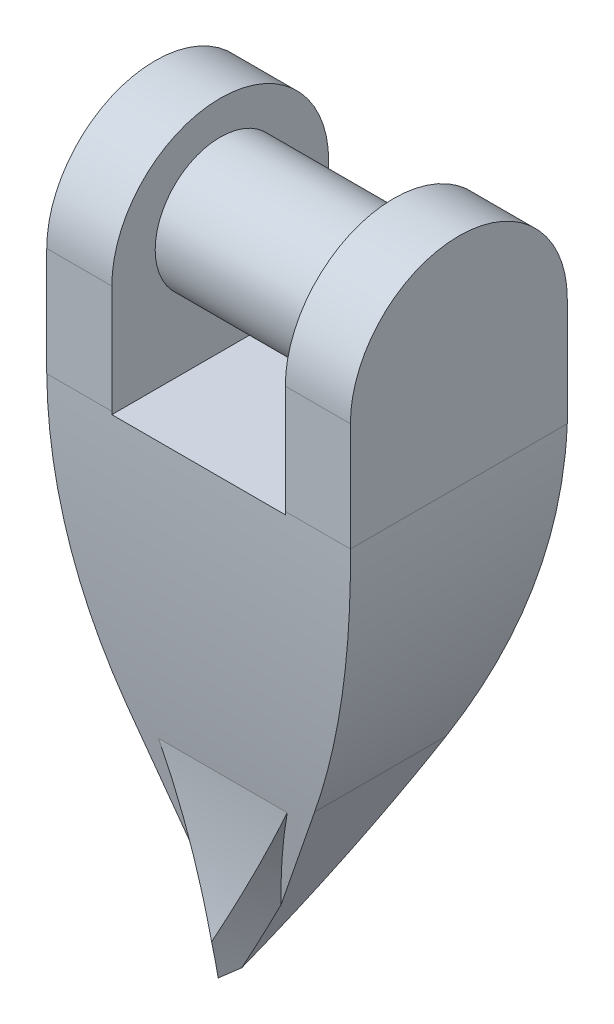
ISO-10303-21;
HEADER;
FILE_DESCRIPTION(('STEP AP214'),'2;1');
FILE_NAME('part.step','',(''),(''),'','','');
FILE_SCHEMA(('AUTOMOTIVE_DESIGN { 1 0 10303 214 1 1 1 1 }'));
ENDSEC;
DATA;
#1=APPLICATION_CONTEXT('core data for automotive mechanical design processes');
#2=APPLICATION_PROTOCOL_DEFINITION('international standard','automotive_design',2000,#1);
#3=PRODUCT_CONTEXT('',#1,'mechanical');
#4=PRODUCT('Part','Part','',(#3));
#5=PRODUCT_RELATED_PRODUCT_CATEGORY('part','',(#4));
#6=PRODUCT_DEFINITION_FORMATION('','',#4);
#7=PRODUCT_DEFINITION_CONTEXT('part definition',#1,'design');
#8=PRODUCT_DEFINITION('design','',#6,#7);
#9=PRODUCT_DEFINITION_SHAPE('','',#8);
#10=(LENGTH_UNIT() NAMED_UNIT(*) SI_UNIT(.MILLI.,.METRE.));
#11=(NAMED_UNIT(*) PLANE_ANGLE_UNIT() SI_UNIT($,.RADIAN.));
#12=(NAMED_UNIT(*) SI_UNIT($,.STERADIAN.) SOLID_ANGLE_UNIT());
#13=UNCERTAINTY_MEASURE_WITH_UNIT(LENGTH_MEASURE(1.E-05),#10,'distance_accuracy_value','');
#14=(GEOMETRIC_REPRESENTATION_CONTEXT(3) GLOBAL_UNCERTAINTY_ASSIGNED_CONTEXT((#13)) GLOBAL_UNIT_ASSIGNED_CONTEXT((#10,
#11,#12)) REPRESENTATION_CONTEXT('',''));
#15=CARTESIAN_POINT('',(0.,0.,0.));
#16=DIRECTION('',(0.,0.,1.));
#17=DIRECTION('',(1.,0.,0.));
#18=AXIS2_PLACEMENT_3D('',#15,#16,#17);
#19=CARTESIAN_POINT('',(-72.2067671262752,6.36949661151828,10.));
#20=DIRECTION('',(0.,0.,1.));
#21=DIRECTION('',(1.,0.,0.));
#22=AXIS2_PLACEMENT_3D('',#19,#20,#21);
#23=PLANE('',#22);
#24=DIRECTION('',(-1.,0.,0.));
#25=VECTOR('',#24,1.);
#26=CARTESIAN_POINT('',(-24.2067671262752,6.36949661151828,10.));
#27=LINE('',#26,#25);
#28=CARTESIAN_POINT('',(-42.2067671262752,6.36949661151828,10.));
#29=VERTEX_POINT('',#28);
#30=CARTESIAN_POINT('',(-45.2067671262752,6.36949661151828,10.));
#31=VERTEX_POINT('',#30);
#32=EDGE_CURVE('E185',#29,#31,#27,.T.);
#33=ORIENTED_EDGE('',*,*,#32,.F.);
#34=DIRECTION('',(0.,1.,0.));
#35=VECTOR('',#34,1.);
#36=CARTESIAN_POINT('',(-42.2067671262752,6.36949661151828,10.));
#37=LINE('',#36,#35);
#38=CARTESIAN_POINT('',(-42.2067671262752,11.3694966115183,10.));
#39=VERTEX_POINT('',#38);
#40=EDGE_CURVE('E206',#29,#39,#37,.T.);
#41=ORIENTED_EDGE('',*,*,#40,.T.);
#42=DIRECTION('',(-1.,0.,0.));
#43=VECTOR('',#42,1.);
#44=CARTESIAN_POINT('',(-32.2067671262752,11.3694966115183,10.));
#45=LINE('',#44,#43);
#46=CARTESIAN_POINT('',(-45.2067671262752,11.3694966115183,10.));
#47=VERTEX_POINT('',#46);
#48=EDGE_CURVE('E228',#39,#47,#45,.T.);
#49=ORIENTED_EDGE('',*,*,#48,.T.);
#50=DIRECTION('',(0.,-1.,0.));
#51=VECTOR('',#50,1.);
#52=CARTESIAN_POINT('',(-45.2067671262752,8.23234043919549,10.));
#53=LINE('',#52,#51);
#54=EDGE_CURVE('E507',#47,#31,#53,.T.);
#55=ORIENTED_EDGE('',*,*,#54,.T.);
#56=EDGE_LOOP('',(#33,#41,#49,#55));
#57=FACE_BOUND('',#56,.T.);
#58=ADVANCED_FACE('F55',(#57),#23,.T.);
#59=CARTESIAN_POINT('',(-72.2067671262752,6.36949661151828,0.));
#60=DIRECTION('',(0.,0.,1.));
#61=DIRECTION('',(1.,0.,0.));
#62=AXIS2_PLACEMENT_3D('',#59,#60,#61);
#63=PLANE('',#62);
#64=DIRECTION('',(0.,1.,0.));
#65=VECTOR('',#64,1.);
#66=CARTESIAN_POINT('',(-42.2067671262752,6.36949661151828,0.));
#67=LINE('',#66,#65);
#68=CARTESIAN_POINT('',(-42.2067671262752,6.36949661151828,0.));
#69=VERTEX_POINT('',#68);
#70=CARTESIAN_POINT('',(-42.2067671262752,11.3694966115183,0.));
#71=VERTEX_POINT('',#70);
#72=EDGE_CURVE('E323',#69,#71,#67,.T.);
#73=ORIENTED_EDGE('',*,*,#72,.F.);
#74=DIRECTION('',(-1.,0.,0.));
#75=VECTOR('',#74,1.);
#76=CARTESIAN_POINT('',(-24.2067671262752,6.36949661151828,0.));
#77=LINE('',#76,#75);
#78=CARTESIAN_POINT('',(-45.2067671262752,6.36949661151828,0.));
#79=VERTEX_POINT('',#78);
#80=EDGE_CURVE('E289',#69,#79,#77,.T.);
#81=ORIENTED_EDGE('',*,*,#80,.T.);
#82=DIRECTION('',(0.,-1.,0.));
#83=VECTOR('',#82,1.);
#84=CARTESIAN_POINT('',(-45.2067671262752,8.23234043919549,0.));
#85=LINE('',#84,#83);
#86=CARTESIAN_POINT('',(-45.2067671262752,11.3694966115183,0.));
#87=VERTEX_POINT('',#86);
#88=EDGE_CURVE('E332',#87,#79,#85,.T.);
#89=ORIENTED_EDGE('',*,*,#88,.F.);
#90=DIRECTION('',(-1.,0.,0.));
#91=VECTOR('',#90,1.);
#92=CARTESIAN_POINT('',(-32.2067671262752,11.3694966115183,0.));
#93=LINE('',#92,#91);
#94=EDGE_CURVE('E226',#71,#87,#93,.T.);
#95=ORIENTED_EDGE('',*,*,#94,.F.);
#96=EDGE_LOOP('',(#73,#81,#89,#95));
#97=FACE_BOUND('',#96,.T.);
#98=ADVANCED_FACE('F330',(#97),#63,.F.);
#99=CARTESIAN_POINT('',(-56.2067671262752,16.3694966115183,10.));
#100=DIRECTION('',(1.,0.,0.));
#101=DIRECTION('',(0.,0.,-1.));
#102=AXIS2_PLACEMENT_3D('',#99,#100,#101);
#103=PLANE('',#102);
#104=DIRECTION('',(0.,-1.,0.));
#105=VECTOR('',#104,1.);
#106=CARTESIAN_POINT('',(-56.2067671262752,16.3694966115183,10.));
#107=LINE('',#106,#105);
#108=CARTESIAN_POINT('',(-56.2067671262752,11.3694966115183,10.));
#109=VERTEX_POINT('',#108);
#110=CARTESIAN_POINT('',(-56.2067671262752,6.36949661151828,10.));
#111=VERTEX_POINT('',#110);
#112=EDGE_CURVE('E200',#109,#111,#107,.T.);
#113=ORIENTED_EDGE('',*,*,#112,.F.);
#114=CARTESIAN_POINT('',(-56.2067671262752,11.3694966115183,5.));
#115=DIRECTION('',(-1.,0.,0.));
#116=DIRECTION('',(0.,0.,1.));
#117=AXIS2_PLACEMENT_3D('',#114,#115,#116);
#118=CIRCLE('',#117,5.);
#119=CARTESIAN_POINT('',(-56.2067671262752,11.3694966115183,0.));
#120=VERTEX_POINT('',#119);
#121=EDGE_CURVE('E351',#109,#120,#118,.T.);
#122=ORIENTED_EDGE('',*,*,#121,.T.);
#123=DIRECTION('',(0.,-1.,0.));
#124=VECTOR('',#123,1.);
#125=CARTESIAN_POINT('',(-56.2067671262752,16.3694966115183,0.));
#126=LINE('',#125,#124);
#127=CARTESIAN_POINT('',(-56.2067671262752,6.36949661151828,0.));
#128=VERTEX_POINT('',#127);
#129=EDGE_CURVE('E212',#120,#128,#126,.T.);
#130=ORIENTED_EDGE('',*,*,#129,.T.);
#131=DIRECTION('',(0.,0.,-1.));
#132=VECTOR('',#131,1.);
#133=CARTESIAN_POINT('',(-56.2067671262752,6.36949661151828,10.));
#134=LINE('',#133,#132);
#135=EDGE_CURVE('E194',#111,#128,#134,.T.);
#136=ORIENTED_EDGE('',*,*,#135,.F.);
#137=EDGE_LOOP('',(#113,#122,#130,#136));
#138=FACE_BOUND('',#137,.T.);
#139=ADVANCED_FACE('F210',(#138),#103,.F.);
#140=CARTESIAN_POINT('',(-42.2067671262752,6.36949661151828,10.));
#141=DIRECTION('',(-1.,0.,0.));
#142=DIRECTION('',(0.,0.,1.));
#143=AXIS2_PLACEMENT_3D('',#140,#141,#142);
#144=PLANE('',#143);
#145=CARTESIAN_POINT('',(-42.2067671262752,11.3694966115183,5.));
#146=DIRECTION('',(-1.,0.,0.));
#147=DIRECTION('',(0.,0.,1.));
#148=AXIS2_PLACEMENT_3D('',#145,#146,#147);
#149=CIRCLE('',#148,5.);
#150=EDGE_CURVE('E513',#39,#71,#149,.T.);
#151=ORIENTED_EDGE('',*,*,#150,.F.);
#152=ORIENTED_EDGE('',*,*,#40,.F.);
#153=DIRECTION('',(0.,0.,-1.));
#154=VECTOR('',#153,1.);
#155=CARTESIAN_POINT('',(-42.2067671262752,6.36949661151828,10.));
#156=LINE('',#155,#154);
#157=EDGE_CURVE('E315',#29,#69,#156,.T.);
#158=ORIENTED_EDGE('',*,*,#157,.T.);
#159=ORIENTED_EDGE('',*,*,#72,.T.);
#160=EDGE_LOOP('',(#151,#152,#158,#159));
#161=FACE_BOUND('',#160,.T.);
#162=ADVANCED_FACE('F322',(#161),#144,.F.);
#163=CARTESIAN_POINT('',(-45.2067671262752,8.23234043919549,10.));
#164=DIRECTION('',(1.,0.,0.));
#165=DIRECTION('',(0.,0.,-1.));
#166=AXIS2_PLACEMENT_3D('',#163,#164,#165);
#167=PLANE('',#166);
#168=CARTESIAN_POINT('',(-45.2067671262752,11.8175438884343,5.));
#169=DIRECTION('',(1.,0.,0.));
#170=DIRECTION('',(0.,0.,-1.));
#171=AXIS2_PLACEMENT_3D('',#168,#169,#170);
#172=CIRCLE('',#171,3.);
#173=CARTESIAN_POINT('',(-45.2067671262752,11.8175438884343,2.));
#174=VERTEX_POINT('',#173);
#175=EDGE_CURVE('E216',#174,#174,#172,.F.);
#176=ORIENTED_EDGE('',*,*,#175,.F.);
#177=EDGE_LOOP('',(#176));
#178=FACE_BOUND('',#177,.T.);
#179=DIRECTION('',(0.,0.,-1.));
#180=VECTOR('',#179,1.);
#181=CARTESIAN_POINT('',(-45.2067671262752,6.23234043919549,0.));
#182=LINE('',#181,#180);
#183=CARTESIAN_POINT('',(-45.2067671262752,6.23234043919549,9.99839916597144));
#184=VERTEX_POINT('',#183);
#185=CARTESIAN_POINT('',(-45.2067671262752,6.23234043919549,0.00596732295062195));
#186=VERTEX_POINT('',#185);
#187=EDGE_CURVE('E335',#184,#186,#182,.T.);
#188=ORIENTED_EDGE('',*,*,#187,.F.);
#189=CARTESIAN_POINT('',(-45.2067671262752,6.36949661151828,10.));
#190=CARTESIAN_POINT('',(-45.2067671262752,-0.227580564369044,9.9280997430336));
#191=CARTESIAN_POINT('',(-45.2067671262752,-6.7392026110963,8.87637244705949));
#192=B_SPLINE_CURVE_WITH_KNOTS('',2,(#189,#190,#191),.UNSPECIFIED.,.F.,.F.,(3,3),(0.,1.),.UNSPECIFIED.);
#193=EDGE_CURVE('E458',#184,#31,#192,.F.);
#194=ORIENTED_EDGE('',*,*,#193,.T.);
#195=ORIENTED_EDGE('',*,*,#54,.F.);
#196=CARTESIAN_POINT('',(-45.2067671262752,11.3694966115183,5.));
#197=DIRECTION('',(1.,0.,0.));
#198=DIRECTION('',(0.,0.,-1.));
#199=AXIS2_PLACEMENT_3D('',#196,#197,#198);
#200=CIRCLE('',#199,5.);
#201=EDGE_CURVE('E350',#87,#47,#200,.T.);
#202=ORIENTED_EDGE('',*,*,#201,.F.);
#203=ORIENTED_EDGE('',*,*,#88,.T.);
#204=CARTESIAN_POINT('',(-45.2067671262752,-15.6075521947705,10.));
#205=CARTESIAN_POINT('',(-45.2067671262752,-6.59301809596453,0.539896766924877));
#206=CARTESIAN_POINT('',(-45.2067671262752,6.36949661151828,0.));
#207=B_SPLINE_CURVE_WITH_KNOTS('',2,(#204,#205,#206),.UNSPECIFIED.,.F.,.F.,(3,3),(0.,1.),.UNSPECIFIED.);
#208=EDGE_CURVE('E294',#79,#186,#207,.F.);
#209=ORIENTED_EDGE('',*,*,#208,.T.);
#210=EDGE_LOOP('',(#188,#194,#195,#202,#203,#209));
#211=FACE_BOUND('',#210,.T.);
#212=ADVANCED_FACE('F478',(#178,#211),#167,.F.);
#213=CARTESIAN_POINT('',(-53.2067671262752,8.23234043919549,10.));
#214=DIRECTION('',(-1.,0.,0.));
#215=DIRECTION('',(0.,0.,1.));
#216=AXIS2_PLACEMENT_3D('',#213,#214,#215);
#217=PLANE('',#216);
#218=CARTESIAN_POINT('',(-53.2067671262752,11.8175438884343,5.));
#219=DIRECTION('',(-1.,0.,0.));
#220=DIRECTION('',(0.,0.,1.));
#221=AXIS2_PLACEMENT_3D('',#218,#219,#220);
#222=CIRCLE('',#221,3.);
#223=CARTESIAN_POINT('',(-53.2067671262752,11.8175438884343,8.));
#224=VERTEX_POINT('',#223);
#225=EDGE_CURVE('E213',#224,#224,#222,.F.);
#226=ORIENTED_EDGE('',*,*,#225,.F.);
#227=EDGE_LOOP('',(#226));
#228=FACE_BOUND('',#227,.T.);
#229=DIRECTION('',(0.,1.,0.));
#230=VECTOR('',#229,1.);
#231=CARTESIAN_POINT('',(-53.2067671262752,8.23234043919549,10.));
#232=LINE('',#231,#230);
#233=CARTESIAN_POINT('',(-53.2067671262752,6.36949661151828,10.));
#234=VERTEX_POINT('',#233);
#235=CARTESIAN_POINT('',(-53.2067671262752,11.3694966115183,10.));
#236=VERTEX_POINT('',#235);
#237=EDGE_CURVE('E325',#234,#236,#232,.T.);
#238=ORIENTED_EDGE('',*,*,#237,.F.);
#239=CARTESIAN_POINT('',(-53.2067671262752,6.36949661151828,10.));
#240=CARTESIAN_POINT('',(-53.2067671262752,-0.227580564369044,9.9280997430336));
#241=CARTESIAN_POINT('',(-53.2067671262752,-6.7392026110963,8.87637244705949));
#242=B_SPLINE_CURVE_WITH_KNOTS('',2,(#239,#240,#241),.UNSPECIFIED.,.F.,.F.,(3,3),(0.,1.),.UNSPECIFIED.);
#243=CARTESIAN_POINT('',(-53.2067671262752,6.23234043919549,9.99839916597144));
#244=VERTEX_POINT('',#243);
#245=EDGE_CURVE('E181',#234,#244,#242,.T.);
#246=ORIENTED_EDGE('',*,*,#245,.T.);
#247=DIRECTION('',(0.,0.,1.));
#248=VECTOR('',#247,1.);
#249=CARTESIAN_POINT('',(-53.2067671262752,6.23234043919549,0.));
#250=LINE('',#249,#248);
#251=CARTESIAN_POINT('',(-53.2067671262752,6.23234043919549,0.00596732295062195));
#252=VERTEX_POINT('',#251);
#253=EDGE_CURVE('E510',#252,#244,#250,.T.);
#254=ORIENTED_EDGE('',*,*,#253,.F.);
#255=CARTESIAN_POINT('',(-53.2067671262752,-15.6075521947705,10.));
#256=CARTESIAN_POINT('',(-53.2067671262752,-6.59301809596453,0.539896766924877));
#257=CARTESIAN_POINT('',(-53.2067671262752,6.36949661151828,0.));
#258=B_SPLINE_CURVE_WITH_KNOTS('',2,(#255,#256,#257),.UNSPECIFIED.,.F.,.F.,(3,3),(0.,1.),.UNSPECIFIED.);
#259=CARTESIAN_POINT('',(-53.2067671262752,6.36949661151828,0.));
#260=VERTEX_POINT('',#259);
#261=EDGE_CURVE('E290',#252,#260,#258,.T.);
#262=ORIENTED_EDGE('',*,*,#261,.T.);
#263=DIRECTION('',(0.,1.,0.));
#264=VECTOR('',#263,1.);
#265=CARTESIAN_POINT('',(-53.2067671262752,8.23234043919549,0.));
#266=LINE('',#265,#264);
#267=CARTESIAN_POINT('',(-53.2067671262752,11.3694966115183,0.));
#268=VERTEX_POINT('',#267);
#269=EDGE_CURVE('E207',#260,#268,#266,.T.);
#270=ORIENTED_EDGE('',*,*,#269,.T.);
#271=CARTESIAN_POINT('',(-53.2067671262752,11.3694966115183,5.));
#272=DIRECTION('',(-1.,0.,0.));
#273=DIRECTION('',(0.,0.,1.));
#274=AXIS2_PLACEMENT_3D('',#271,#272,#273);
#275=CIRCLE('',#274,5.);
#276=EDGE_CURVE('E344',#236,#268,#275,.T.);
#277=ORIENTED_EDGE('',*,*,#276,.F.);
#278=EDGE_LOOP('',(#238,#246,#254,#262,#270,#277));
#279=FACE_BOUND('',#278,.T.);
#280=ADVANCED_FACE('F343',(#228,#279),#217,.F.);
#281=EDGE_CURVE('E176',#234,#111,#27,.T.);
#282=ORIENTED_EDGE('',*,*,#281,.F.);
#283=ORIENTED_EDGE('',*,*,#237,.T.);
#284=EDGE_CURVE('E203',#236,#109,#45,.T.);
#285=ORIENTED_EDGE('',*,*,#284,.T.);
#286=ORIENTED_EDGE('',*,*,#112,.T.);
#287=EDGE_LOOP('',(#282,#283,#285,#286));
#288=FACE_BOUND('',#287,.T.);
#289=ADVANCED_FACE('F201',(#288),#23,.T.);
#290=ORIENTED_EDGE('',*,*,#269,.F.);
#291=EDGE_CURVE('E196',#260,#128,#77,.T.);
#292=ORIENTED_EDGE('',*,*,#291,.T.);
#293=ORIENTED_EDGE('',*,*,#129,.F.);
#294=EDGE_CURVE('E224',#268,#120,#93,.T.);
#295=ORIENTED_EDGE('',*,*,#294,.F.);
#296=EDGE_LOOP('',(#290,#292,#293,#295));
#297=FACE_BOUND('',#296,.T.);
#298=ADVANCED_FACE('F353',(#297),#63,.F.);
#299=CARTESIAN_POINT('',(-26.2067671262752,6.36949661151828,10.));
#300=DIRECTION('',(0.,0.,-1.));
#301=DIRECTION('',(-1.,0.,0.));
#302=AXIS2_PLACEMENT_3D('',#299,#300,#301);
#303=CYLINDRICAL_SURFACE('',#302,30.);
#304=DIRECTION('',(0.,0.,-1.));
#305=VECTOR('',#304,1.);
#306=CARTESIAN_POINT('',(-53.5560371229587,-5.96003828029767,10.));
#307=LINE('',#306,#305);
#308=CARTESIAN_POINT('',(-53.5560371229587,-5.96003828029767,8.99866560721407));
#309=VERTEX_POINT('',#308);
#310=CARTESIAN_POINT('',(-53.5560371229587,-5.96003828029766,2.93382946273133));
#311=VERTEX_POINT('',#310);
#312=EDGE_CURVE('E195',#309,#311,#307,.T.);
#313=ORIENTED_EDGE('',*,*,#312,.F.);
#314=CARTESIAN_POINT('',(-53.5560371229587,-5.96003828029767,8.99866560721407));
#315=CARTESIAN_POINT('',(-53.7212182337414,-5.59364563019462,9.05450743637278));
#316=CARTESIAN_POINT('',(-53.8791336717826,-5.22369689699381,9.10852788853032));
#317=CARTESIAN_POINT('',(-54.1801500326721,-4.47724232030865,9.2126171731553));
#318=CARTESIAN_POINT('',(-54.3232498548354,-4.10073599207,9.26268571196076));
#319=CARTESIAN_POINT('',(-54.5942972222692,-3.34185978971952,9.35854331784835));
#320=CARTESIAN_POINT('',(-54.7222481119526,-2.95949123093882,9.40433332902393));
#321=CARTESIAN_POINT('',(-54.9627538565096,-2.18947198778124,9.49136322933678));
#322=CARTESIAN_POINT('',(-55.0753095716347,-1.80182159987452,9.53260337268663));
#323=CARTESIAN_POINT('',(-55.3480985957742,-0.786088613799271,9.63375989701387));
#324=CARTESIAN_POINT('',(-55.4960406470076,-0.154274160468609,9.6899023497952));
#325=CARTESIAN_POINT('',(-55.7507661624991,1.11846206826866,9.78894274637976));
#326=CARTESIAN_POINT('',(-55.8575562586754,1.75938235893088,9.83184282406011));
#327=CARTESIAN_POINT('',(-56.0310080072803,3.05995475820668,9.9044749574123));
#328=CARTESIAN_POINT('',(-56.0968642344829,3.71973082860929,9.93393984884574));
#329=CARTESIAN_POINT('',(-56.1627765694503,4.71193238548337,9.96705138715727));
#330=CARTESIAN_POINT('',(-56.1792686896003,5.04316616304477,9.97624177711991));
#331=CARTESIAN_POINT('',(-56.2012641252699,5.70608249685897,9.99090920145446));
#332=CARTESIAN_POINT('',(-56.2067673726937,6.03776505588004,9.99638621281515));
#333=CARTESIAN_POINT('',(-56.2067671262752,6.36949661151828,10.));
#334=B_SPLINE_CURVE_WITH_KNOTS('',3,(#314,#315,#316,#317,#318,#319,#320,#321,#322,#323,#324,
#325,#326,#327,#328,#329,#330,#331,#332,#333),.UNSPECIFIED.,.F.,.F.,(4,2,2,2,2,2,2,2,2,4),(0.,
1.21721866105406,2.43452768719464,3.65156746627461,4.86853921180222,6.82092562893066,
8.7729972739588,10.7623540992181,11.7574936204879,12.7526393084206),.UNSPECIFIED.);
#335=EDGE_CURVE('E179',#309,#111,#334,.T.);
#336=ORIENTED_EDGE('',*,*,#335,.T.);
#337=ORIENTED_EDGE('',*,*,#135,.T.);
#338=CARTESIAN_POINT('',(-56.2067671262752,6.36949661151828,0.));
#339=CARTESIAN_POINT('',(-56.2067780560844,6.01666838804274,0.014682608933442));
#340=CARTESIAN_POINT('',(-56.2005431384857,5.66404578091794,0.0344297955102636));
#341=CARTESIAN_POINT('',(-56.1757037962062,4.95997987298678,0.0842720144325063));
#342=CARTESIAN_POINT('',(-56.1570997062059,4.60853654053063,0.114366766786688));
#343=CARTESIAN_POINT('',(-56.1076447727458,3.9075862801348,0.185122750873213));
#344=CARTESIAN_POINT('',(-56.0767942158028,3.55807930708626,0.225783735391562));
#345=CARTESIAN_POINT('',(-56.0037155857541,2.8680643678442,0.316959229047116));
#346=CARTESIAN_POINT('',(-55.9617038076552,2.52750809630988,0.367281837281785));
#347=CARTESIAN_POINT('',(-55.8663111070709,1.84969777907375,0.47827139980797));
#348=CARTESIAN_POINT('',(-55.8129304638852,1.51244365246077,0.538938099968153));
#349=CARTESIAN_POINT('',(-55.6951001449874,0.841921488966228,0.670576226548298));
#350=CARTESIAN_POINT('',(-55.6306508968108,0.50865329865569,0.741547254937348));
#351=CARTESIAN_POINT('',(-55.4853461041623,-0.180204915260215,0.899873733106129));
#352=CARTESIAN_POINT('',(-55.4035824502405,-0.535405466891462,0.988092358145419));
#353=CARTESIAN_POINT('',(-55.2279945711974,-1.23971499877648,1.17622337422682));
#354=CARTESIAN_POINT('',(-55.1341689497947,-1.58882326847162,1.27613711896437));
#355=CARTESIAN_POINT('',(-54.9349825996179,-2.28030784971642,1.48734026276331));
#356=CARTESIAN_POINT('',(-54.8296198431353,-2.62268296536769,1.59863166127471));
#357=CARTESIAN_POINT('',(-54.60571496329,-3.30686186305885,1.83451006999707));
#358=CARTESIAN_POINT('',(-54.4869508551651,-3.6485164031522,1.95931901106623));
#359=CARTESIAN_POINT('',(-54.2386613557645,-4.32359551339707,2.21981268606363));
#360=CARTESIAN_POINT('',(-54.1091375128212,-4.65702125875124,2.3554958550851));
#361=CARTESIAN_POINT('',(-53.8400055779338,-5.3151314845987,2.63710908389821));
#362=CARTESIAN_POINT('',(-53.7004029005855,-5.63982053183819,2.78303364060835));
#363=CARTESIAN_POINT('',(-53.5560371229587,-5.96003828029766,2.93382946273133));
#364=B_SPLINE_CURVE_WITH_KNOTS('',3,(#338,#339,#340,#341,#342,#343,#344,#345,#346,#347,#348,
#349,#350,#351,#352,#353,#354,#355,#356,#357,#358,#359,#360,#361,#362,#363),.UNSPECIFIED.,.F.,
.F.,(4,2,2,2,2,2,2,2,2,2,2,2,4),(0.,1.05931685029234,2.11860503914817,3.17786844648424,
4.21793756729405,5.25798113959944,6.29798454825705,7.42258712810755,8.54732000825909,
9.67225088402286,10.8197485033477,11.9670812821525,13.1138022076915),.UNSPECIFIED.);
#365=EDGE_CURVE('E356',#128,#311,#364,.T.);
#366=ORIENTED_EDGE('',*,*,#365,.T.);
#367=EDGE_LOOP('',(#313,#336,#337,#366));
#368=FACE_BOUND('',#367,.T.);
#369=ADVANCED_FACE('F191',(#368),#303,.T.);
#370=CARTESIAN_POINT('',(-53.5560371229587,-5.96003828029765,10.));
#371=DIRECTION('',(0.911642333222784,0.410984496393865,0.));
#372=DIRECTION('',(-0.410984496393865,0.911642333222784,0.));
#373=AXIS2_PLACEMENT_3D('',#370,#371,#372);
#374=PLANE('',#373);
#375=CARTESIAN_POINT('',(-53.5560371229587,-5.96003828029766,2.93382946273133));
#376=CARTESIAN_POINT('',(-53.4206857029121,-6.26027365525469,3.07519196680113));
#377=CARTESIAN_POINT('',(-53.2862463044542,-6.5584859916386,3.2217246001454));
#378=CARTESIAN_POINT('',(-53.0199393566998,-7.14920581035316,3.52428415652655));
#379=CARTESIAN_POINT('',(-52.8880628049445,-7.44173326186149,3.68026416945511));
#380=CARTESIAN_POINT('',(-52.6268544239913,-8.02114348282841,4.00159384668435));
#381=CARTESIAN_POINT('',(-52.4975150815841,-8.30804291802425,4.16690735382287));
#382=CARTESIAN_POINT('',(-52.2413521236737,-8.87626142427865,4.5067702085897));
#383=CARTESIAN_POINT('',(-52.114522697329,-9.15759338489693,4.68129362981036));
#384=CARTESIAN_POINT('',(-51.8633511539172,-9.71473997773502,5.03944720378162));
#385=CARTESIAN_POINT('',(-51.7390050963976,-9.99056335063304,5.2230609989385));
#386=CARTESIAN_POINT('',(-51.4927718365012,-10.5367558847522,5.59926731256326));
#387=CARTESIAN_POINT('',(-51.3708826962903,-10.8071293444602,5.7918523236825));
#388=CARTESIAN_POINT('',(-51.1295823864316,-11.3423796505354,6.18579780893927));
#389=CARTESIAN_POINT('',(-51.0101704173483,-11.6072582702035,6.38715538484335));
#390=CARTESIAN_POINT('',(-50.773738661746,-12.1317091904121,6.79860717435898));
#391=CARTESIAN_POINT('',(-50.6567213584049,-12.3912759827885,7.00870983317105));
#392=CARTESIAN_POINT('',(-50.425044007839,-12.9051807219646,7.43754582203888));
#393=CARTESIAN_POINT('',(-50.3103887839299,-13.1595079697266,7.65629457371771));
#394=CARTESIAN_POINT('',(-50.0834014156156,-13.6630094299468,8.10232060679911));
#395=CARTESIAN_POINT('',(-49.9710764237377,-13.9121677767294,8.32961943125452));
#396=CARTESIAN_POINT('',(-49.7487171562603,-14.405403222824,8.7926473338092));
#397=CARTESIAN_POINT('',(-49.6386923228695,-14.6494593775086,9.0284032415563));
#398=CARTESIAN_POINT('',(-49.4208988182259,-15.1325670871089,9.50825010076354));
#399=CARTESIAN_POINT('',(-49.3131417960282,-15.3715928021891,9.75237236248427));
#400=CARTESIAN_POINT('',(-49.2067671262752,-15.6075521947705,10.));
#401=B_SPLINE_CURVE_WITH_KNOTS('',3,(#375,#376,#377,#378,#379,#380,#381,#382,#383,#384,#385,
#386,#387,#388,#389,#390,#391,#392,#393,#394,#395,#396,#397,#398,#399,#400),.UNSPECIFIED.,.F.,
.F.,(4,2,2,2,2,2,2,2,2,2,2,2,4),(0.,1.07513122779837,2.14530339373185,3.21158166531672,
4.27500367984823,5.33657714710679,6.39727768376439,7.45763041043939,8.51903203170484,
9.58242077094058,10.6486966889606,11.7187214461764,12.7933182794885),.UNSPECIFIED.);
#402=CARTESIAN_POINT('',(-49.828756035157,-14.2278616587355,8.62615458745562));
#403=VERTEX_POINT('',#402);
#404=EDGE_CURVE('E238',#311,#403,#401,.T.);
#405=ORIENTED_EDGE('',*,*,#404,.T.);
#406=CARTESIAN_POINT('',(-53.4220431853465,-6.25726249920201,7.99961478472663));
#407=CARTESIAN_POINT('',(-53.3744600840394,-6.36281093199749,7.99656626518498));
#408=CARTESIAN_POINT('',(-53.3268769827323,-6.46835936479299,7.99351774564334));
#409=CARTESIAN_POINT('',(-53.2555023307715,-6.62668201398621,7.98894496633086));
#410=CARTESIAN_POINT('',(-53.231710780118,-6.67945623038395,7.98742070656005));
#411=CARTESIAN_POINT('',(-53.1841276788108,-6.78500466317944,7.98437218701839));
#412=CARTESIAN_POINT('',(-53.1603361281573,-6.83777887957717,7.98284792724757));
#413=CARTESIAN_POINT('',(-53.1246488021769,-6.91694020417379,7.98056153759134));
#414=CARTESIAN_POINT('',(-53.1127530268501,-6.94332731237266,7.97979940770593));
#415=CARTESIAN_POINT('',(-53.0889614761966,-6.99610152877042,7.9782751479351));
#416=CARTESIAN_POINT('',(-53.0770656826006,-7.02248867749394,7.97751184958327));
#417=CARTESIAN_POINT('',(-53.0592220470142,-7.06206927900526,7.97637040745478));
#418=CARTESIAN_POINT('',(-53.0532741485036,-7.07526285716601,7.97598864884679));
#419=CARTESIAN_POINT('',(-53.0443523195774,-7.09505318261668,7.97541721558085));
#420=CARTESIAN_POINT('',(-53.0413783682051,-7.10164997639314,7.97522620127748));
#421=CARTESIAN_POINT('',(-53.035430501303,-7.11484348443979,7.9748464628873));
#422=CARTESIAN_POINT('',(-53.0324566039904,-7.12144015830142,7.97465890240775));
#423=CARTESIAN_POINT('',(-53.0235350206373,-7.14122993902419,7.97410315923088));
#424=CARTESIAN_POINT('',(-53.0175874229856,-7.15442284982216,7.9737406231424));
#425=CARTESIAN_POINT('',(-53.0056925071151,-7.18080805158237,7.97303340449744));
#426=CARTESIAN_POINT('',(-52.9997451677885,-7.1940003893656,7.97268737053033));
#427=CARTESIAN_POINT('',(-52.970009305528,-7.25996022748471,7.97101053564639));
#428=CARTESIAN_POINT('',(-52.9462226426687,-7.31272360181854,7.96979854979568));
#429=CARTESIAN_POINT('',(-52.8986537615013,-7.41824049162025,7.96765856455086));
#430=CARTESIAN_POINT('',(-52.8748714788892,-7.47099414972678,7.96672644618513));
#431=CARTESIAN_POINT('',(-52.8035311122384,-7.62924074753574,7.96434417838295));
#432=CARTESIAN_POINT('',(-52.755979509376,-7.73471931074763,7.96330811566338));
#433=CARTESIAN_POINT('',(-52.6608936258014,-7.94563801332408,7.96234271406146));
#434=CARTESIAN_POINT('',(-52.6133593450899,-8.05107815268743,7.96241337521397));
#435=CARTESIAN_POINT('',(-52.4707825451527,-8.36734080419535,7.96428921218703));
#436=CARTESIAN_POINT('',(-52.375766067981,-8.57810555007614,7.96775823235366));
#437=CARTESIAN_POINT('',(-52.090821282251,-9.21016766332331,7.98485118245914));
#438=CARTESIAN_POINT('',(-51.900997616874,-9.63123291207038,8.00516083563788));
#439=CARTESIAN_POINT('',(-51.5216319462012,-10.4727386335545,8.06377559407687));
#440=CARTESIAN_POINT('',(-51.3321041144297,-10.8931476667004,8.10207717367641));
#441=CARTESIAN_POINT('',(-50.9532761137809,-11.7334607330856,8.1968621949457));
#442=CARTESIAN_POINT('',(-50.764459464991,-12.1522922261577,8.25322782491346));
#443=CARTESIAN_POINT('',(-50.3881160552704,-12.9870939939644,8.38377690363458));
#444=CARTESIAN_POINT('',(-50.2005713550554,-13.4031040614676,8.45796483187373));
#445=CARTESIAN_POINT('',(-49.9201916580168,-14.0250399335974,8.58254203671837));
#446=CARTESIAN_POINT('',(-49.8268878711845,-14.2320056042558,8.62628371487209));
#447=CARTESIAN_POINT('',(-49.6405916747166,-14.6452462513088,8.71818693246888));
#448=CARTESIAN_POINT('',(-49.5475980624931,-14.8515238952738,8.76634918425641));
#449=CARTESIAN_POINT('',(-49.4083441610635,-15.1604157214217,8.84189646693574));
#450=CARTESIAN_POINT('',(-49.3619627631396,-15.2632985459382,8.86763123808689));
#451=CARTESIAN_POINT('',(-49.2692828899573,-15.468880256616,8.92019813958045));
#452=CARTESIAN_POINT('',(-49.2229736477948,-15.5716030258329,8.94703669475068));
#453=CARTESIAN_POINT('',(-49.1535971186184,-15.7254934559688,8.988101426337));
#454=CARTESIAN_POINT('',(-49.1304863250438,-15.7767576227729,9.00192398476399));
#455=CARTESIAN_POINT('',(-49.0842931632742,-15.8792229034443,9.02983783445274));
#456=CARTESIAN_POINT('',(-49.0612109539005,-15.9304236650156,9.04392902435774));
#457=CARTESIAN_POINT('',(-49.0266091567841,-16.007177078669,9.06526683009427));
#458=CARTESIAN_POINT('',(-49.015078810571,-16.0327535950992,9.07241293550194));
#459=CARTESIAN_POINT('',(-48.992025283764,-16.0838907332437,9.08677209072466));
#460=CARTESIAN_POINT('',(-48.9805021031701,-16.1094513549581,9.09398514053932));
#461=CARTESIAN_POINT('',(-48.9632227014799,-16.1477803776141,9.10485487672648));
#462=CARTESIAN_POINT('',(-48.9574637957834,-16.1605547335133,9.10848648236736));
#463=CARTESIAN_POINT('',(-48.9459477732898,-16.18609947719,9.11576640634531));
#464=CARTESIAN_POINT('',(-48.940190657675,-16.1988698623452,9.11941473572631));
#465=CARTESIAN_POINT('',(-48.9315563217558,-16.2180224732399,9.12489972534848));
#466=CARTESIAN_POINT('',(-48.9286784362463,-16.2244061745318,9.12673017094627));
#467=CARTESIAN_POINT('',(-48.9229231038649,-16.2371726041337,9.13039516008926));
#468=CARTESIAN_POINT('',(-48.9200456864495,-16.2435552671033,9.13222997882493));
#469=CARTESIAN_POINT('',(-48.9142911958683,-16.2563198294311,9.13590283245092));
#470=CARTESIAN_POINT('',(-48.9114139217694,-16.2627021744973,9.13773899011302));
#471=CARTESIAN_POINT('',(-48.9056594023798,-16.2754668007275,9.1414115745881));
#472=CARTESIAN_POINT('',(-48.902782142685,-16.2818491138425,9.14324786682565));
#473=CARTESIAN_POINT('',(-48.8999048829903,-16.2882314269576,9.1450841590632));
#474=B_SPLINE_CURVE_WITH_KNOTS('',3,(#406,#407,#408,#409,#410,#411,#412,#413,#414,#415,#416,
#417,#418,#419,#420,#421,#422,#423,#424,#425,#426,#427,#428,#429,#430,#431,#432,#433,#434,#435,
#436,#437,#438,#439,#440,#441,#442,#443,#444,#445,#446,#447,#448,#449,#450,#451,#452,#453,#454,
#455,#456,#457,#458,#459,#460,#461,#462,#463,#464,#465,#466,#467,#468,#469,#470,#471,#472,#473),
.UNSPECIFIED.,.F.,.F.,(4,2,2,2,2,2,2,2,2,2,2,2,2,2,2,2,2,2,2,2,2,2,2,2,2,2,2,2,2,2,2,2,2,4),
(0.00386169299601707,0.00420910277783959,0.00438280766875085,0.00455651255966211,
0.00464336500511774,0.00473021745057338,0.00477364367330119,0.0047953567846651,
0.004817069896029,0.00486049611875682,0.00490392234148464,0.0050776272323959,
0.00525133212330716,0.00559874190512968,0.0059461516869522,0.00664097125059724,
0.00803061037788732,0.00942024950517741,0.0108098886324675,0.0121995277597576,
0.0128943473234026,0.0135891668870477,0.0139365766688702,0.0142839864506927,0.014457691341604,
0.0146313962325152,0.0147182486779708,0.0148051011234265,0.0148485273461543,0.0148919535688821,
0.014913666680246,0.0149353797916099,0.0149570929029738,0.0149788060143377),.UNSPECIFIED.);
#475=CARTESIAN_POINT('',(-51.1622760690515,-11.2698588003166,8.14460166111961));
#476=VERTEX_POINT('',#475);
#477=EDGE_CURVE('E431',#403,#476,#474,.F.);
#478=ORIENTED_EDGE('',*,*,#477,.T.);
#479=CARTESIAN_POINT('',(-51.1622760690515,-11.2698588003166,8.14460166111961));
#480=CARTESIAN_POINT('',(-51.3324850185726,-10.8923027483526,8.2055831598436));
#481=CARTESIAN_POINT('',(-51.5026940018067,-10.514746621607,8.26656410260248));
#482=CARTESIAN_POINT('',(-51.8431118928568,-9.75963453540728,8.38852596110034));
#483=CARTESIAN_POINT('',(-52.0133208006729,-9.38207857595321,8.44950687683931));
#484=CARTESIAN_POINT('',(-52.2686335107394,-8.81574608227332,8.54097886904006));
#485=CARTESIAN_POINT('',(-52.3537373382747,-8.62696949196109,8.57146952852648));
#486=CARTESIAN_POINT('',(-52.5239450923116,-8.2494160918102,8.63244917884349));
#487=CARTESIAN_POINT('',(-52.6090490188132,-8.06063928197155,8.66293816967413));
#488=CARTESIAN_POINT('',(-52.779256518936,-7.68308644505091,8.72392255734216));
#489=CARTESIAN_POINT('',(-52.8643600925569,-7.49431041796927,8.75441795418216));
#490=CARTESIAN_POINT('',(-52.992016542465,-7.21114396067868,8.8001431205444));
#491=CARTESIAN_POINT('',(-53.0345688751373,-7.11675473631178,8.81538185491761));
#492=CARTESIAN_POINT('',(-53.1196715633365,-6.92798067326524,8.84589198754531));
#493=CARTESIAN_POINT('',(-53.1622219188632,-6.83359583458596,8.86116338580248));
#494=CARTESIAN_POINT('',(-53.2340320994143,-6.67430709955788,8.88682870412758));
#495=CARTESIAN_POINT('',(-53.2632899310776,-6.60940762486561,8.89725549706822));
#496=CARTESIAN_POINT('',(-53.321815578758,-6.47958652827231,8.91794117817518));
#497=CARTESIAN_POINT('',(-53.351083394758,-6.41466490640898,8.92820006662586));
#498=CARTESIAN_POINT('',(-53.4096271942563,-6.28480354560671,8.94857851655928));
#499=CARTESIAN_POINT('',(-53.43890317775,-6.21986380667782,8.95869807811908));
#500=CARTESIAN_POINT('',(-53.4974637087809,-6.08996533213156,8.9787921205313));
#501=CARTESIAN_POINT('',(-53.526748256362,-6.02500659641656,8.98876660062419));
#502=CARTESIAN_POINT('',(-53.5560371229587,-5.96003828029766,8.99866560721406));
#503=B_SPLINE_CURVE_WITH_KNOTS('',3,(#479,#480,#481,#482,#483,#484,#485,#486,#487,#488,#489,
#490,#491,#492,#493,#494,#495,#496,#497,#498,#499,#500,#501,#502),.UNSPECIFIED.,.F.,.F.,(4,2,2,
2,2,2,2,2,2,2,2,4),(0.,1.25584458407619,2.51168861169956,3.13960619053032,3.76752375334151,
4.39544157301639,4.70940049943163,5.02335945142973,5.23920679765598,5.45505377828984,
5.67090063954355,5.88674863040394),.UNSPECIFIED.);
#504=EDGE_CURVE('E78',#476,#309,#503,.T.);
#505=ORIENTED_EDGE('',*,*,#504,.T.);
#506=ORIENTED_EDGE('',*,*,#312,.T.);
#507=EDGE_LOOP('',(#405,#478,#505,#506));
#508=FACE_BOUND('',#507,.T.);
#509=ADVANCED_FACE('F366',(#508),#374,.F.);
#510=CARTESIAN_POINT('',(-49.2067671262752,-15.6075521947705,10.));
#511=DIRECTION('',(-0.911642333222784,0.410984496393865,0.));
#512=DIRECTION('',(-0.410984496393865,-0.911642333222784,0.));
#513=AXIS2_PLACEMENT_3D('',#510,#511,#512);
#514=PLANE('',#513);
#515=CARTESIAN_POINT('',(-44.8574971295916,-5.96003828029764,8.99866560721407));
#516=CARTESIAN_POINT('',(-44.8867859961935,-6.02500659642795,8.98876660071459));
#517=CARTESIAN_POINT('',(-44.9160705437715,-6.08996533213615,8.97879212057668));
#518=CARTESIAN_POINT('',(-44.9746310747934,-6.21986380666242,8.95869807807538));
#519=CARTESIAN_POINT('',(-45.0039070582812,-6.28480354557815,8.94857851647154));
#520=CARTESIAN_POINT('',(-45.0624508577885,-6.41466490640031,8.92820006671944));
#521=CARTESIAN_POINT('',(-45.0917186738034,-6.47958652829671,8.91794117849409));
#522=CARTESIAN_POINT('',(-45.1502443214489,-6.60940762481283,8.89725549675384));
#523=CARTESIAN_POINT('',(-45.1795021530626,-6.67430709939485,8.88682870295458));
#524=CARTESIAN_POINT('',(-45.2513172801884,-6.8336068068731,8.86116161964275));
#525=CARTESIAN_POINT('',(-45.2938725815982,-6.92800261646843,8.84588844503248));
#526=CARTESIAN_POINT('',(-45.3789851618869,-7.11679862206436,8.81537476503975));
#527=CARTESIAN_POINT('',(-45.4215424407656,-7.2111988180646,8.80013425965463));
#528=CARTESIAN_POINT('',(-45.5492137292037,-7.49439819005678,8.75440377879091));
#529=CARTESIAN_POINT('',(-45.6343271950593,-7.68319616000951,8.7239048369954));
#530=CARTESIAN_POINT('',(-45.8045544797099,-8.06079288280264,8.66291336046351));
#531=CARTESIAN_POINT('',(-45.8896682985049,-8.2495916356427,8.6324208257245));
#532=CARTESIAN_POINT('',(-46.0598958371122,-8.62718892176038,8.57143408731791));
#533=CARTESIAN_POINT('',(-46.1450095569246,-8.81598745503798,8.54093988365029));
#534=CARTESIAN_POINT('',(-46.4003519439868,-9.38238577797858,8.44945725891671));
#535=CARTESIAN_POINT('',(-46.5705806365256,-9.75998562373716,8.3884692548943));
#536=CARTESIAN_POINT('',(-46.9110380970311,-10.5151854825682,8.26649321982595));
#537=CARTESIAN_POINT('',(-47.0812668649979,-10.8927854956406,8.20550518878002));
#538=CARTESIAN_POINT('',(-47.2514955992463,-11.2703854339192,8.14451660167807));
#539=B_SPLINE_CURVE_WITH_KNOTS('',3,(#515,#516,#517,#518,#519,#520,#521,#522,#523,#524,#525,
#526,#527,#528,#529,#530,#531,#532,#533,#534,#535,#536,#537,#538),.UNSPECIFIED.,.F.,.F.,(4,2,2,
2,2,2,2,2,2,2,2,4),(0.,0.21584799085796,0.431694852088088,0.647541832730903,0.863389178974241,
1.17738462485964,1.49138004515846,2.11937085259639,2.74736140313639,3.37535196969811,
4.63134197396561,5.8873325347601),.UNSPECIFIED.);
#540=CARTESIAN_POINT('',(-44.8574971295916,-5.96003828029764,8.99866560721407));
#541=VERTEX_POINT('',#540);
#542=CARTESIAN_POINT('',(-47.2514955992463,-11.2703854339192,8.14451660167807));
#543=VERTEX_POINT('',#542);
#544=EDGE_CURVE('E418',#541,#543,#539,.T.);
#545=ORIENTED_EDGE('',*,*,#544,.T.);
#546=CARTESIAN_POINT('',(-49.5136363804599,-16.2882469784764,9.1449353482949));
#547=CARTESIAN_POINT('',(-49.5107592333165,-16.2818649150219,9.14309912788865));
#548=CARTESIAN_POINT('',(-49.5078820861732,-16.2754828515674,9.14126290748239));
#549=CARTESIAN_POINT('',(-49.5021277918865,-16.2627187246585,9.13759046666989));
#550=CARTESIAN_POINT('',(-49.4992506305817,-16.2563366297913,9.13575437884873));
#551=CARTESIAN_POINT('',(-49.4934963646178,-16.2435725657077,9.13208167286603));
#552=CARTESIAN_POINT('',(-49.4906190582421,-16.2371901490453,9.13024694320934));
#553=CARTESIAN_POINT('',(-49.4848639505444,-16.2244242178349,9.12658211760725));
#554=CARTESIAN_POINT('',(-49.4819861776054,-16.2180407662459,9.12475175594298));
#555=CARTESIAN_POINT('',(-49.4733521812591,-16.1988889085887,9.1192670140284));
#556=CARTESIAN_POINT('',(-49.4675952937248,-16.1861190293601,9.11561885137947));
#557=CARTESIAN_POINT('',(-49.4560797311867,-16.1605753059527,9.10833926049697));
#558=CARTESIAN_POINT('',(-49.4503210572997,-16.1478014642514,9.10470782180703));
#559=CARTESIAN_POINT('',(-49.433042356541,-16.1094739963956,9.09383858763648));
#560=CARTESIAN_POINT('',(-49.4215196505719,-16.0839144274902,9.08662587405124));
#561=CARTESIAN_POINT('',(-49.3984670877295,-16.0327794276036,9.07226739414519));
#562=CARTESIAN_POINT('',(-49.386937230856,-16.0072039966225,9.06512162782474));
#563=CARTESIAN_POINT('',(-49.3523369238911,-15.9304538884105,9.04378484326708));
#564=CARTESIAN_POINT('',(-49.3292557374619,-15.879255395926,9.0296943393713));
#565=CARTESIAN_POINT('',(-49.2830646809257,-15.7767947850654,9.00178187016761));
#566=CARTESIAN_POINT('',(-49.2599544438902,-15.7255318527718,8.9879596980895));
#567=CARTESIAN_POINT('',(-49.1905828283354,-15.5716523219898,8.94689798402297));
#568=CARTESIAN_POINT('',(-49.1442700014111,-15.4689216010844,8.9200573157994));
#569=CARTESIAN_POINT('',(-49.051569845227,-15.2632948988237,8.86747921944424));
#570=CARTESIAN_POINT('',(-49.0051809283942,-15.1603953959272,8.84174053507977));
#571=CARTESIAN_POINT('',(-48.8659070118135,-14.8514591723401,8.76618359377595));
#572=CARTESIAN_POINT('',(-48.772899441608,-14.6451505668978,8.71801511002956));
#573=CARTESIAN_POINT('',(-48.5865837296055,-14.231866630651,8.6261048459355));
#574=CARTESIAN_POINT('',(-48.4932727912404,-14.0248850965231,8.58236139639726));
#575=CARTESIAN_POINT('',(-48.2128795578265,-13.4029191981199,8.4577830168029));
#576=CARTESIAN_POINT('',(-48.0253368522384,-12.9869135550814,8.3835999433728));
#577=CARTESIAN_POINT('',(-47.6490172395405,-12.1521645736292,8.25306512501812));
#578=CARTESIAN_POINT('',(-47.4602575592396,-11.7334594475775,8.19671771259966));
#579=CARTESIAN_POINT('',(-47.0814283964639,-10.8931438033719,8.10193359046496));
#580=CARTESIAN_POINT('',(-46.8918383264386,-10.4725967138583,8.06362055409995));
#581=CARTESIAN_POINT('',(-46.5124405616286,-9.63101980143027,8.00500710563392));
#582=CARTESIAN_POINT('',(-46.3226097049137,-9.2099386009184,7.98470086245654));
#583=CARTESIAN_POINT('',(-46.0376706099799,-8.57788911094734,7.96761358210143));
#584=CARTESIAN_POINT('',(-45.9426585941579,-8.36713426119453,7.96414650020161));
#585=CARTESIAN_POINT('',(-45.8000923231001,-8.05089496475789,7.96227310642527));
#586=CARTESIAN_POINT('',(-45.7525621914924,-7.94546402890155,7.96220318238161));
#587=CARTESIAN_POINT('',(-45.6574858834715,-7.73456656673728,7.96316981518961));
#588=CARTESIAN_POINT('',(-45.609939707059,-7.62910004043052,7.96420637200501));
#589=CARTESIAN_POINT('',(-45.5386084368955,-7.47087362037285,7.96658913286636));
#590=CARTESIAN_POINT('',(-45.5148293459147,-7.41812704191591,7.96752137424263));
#591=CARTESIAN_POINT('',(-45.4672671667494,-7.31262501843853,7.96966151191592));
#592=CARTESIAN_POINT('',(-45.443484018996,-7.25986944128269,7.97087352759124));
#593=CARTESIAN_POINT('',(-45.4137527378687,-7.19391976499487,7.97255033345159));
#594=CARTESIAN_POINT('',(-45.4078063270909,-7.18072948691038,7.97289635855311));
#595=CARTESIAN_POINT('',(-45.3959132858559,-7.15434844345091,7.97360355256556));
#596=CARTESIAN_POINT('',(-45.389966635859,-7.1411576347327,7.97396607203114));
#597=CARTESIAN_POINT('',(-45.3810464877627,-7.12137103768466,7.97452178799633));
#598=CARTESIAN_POINT('',(-45.3780730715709,-7.11477543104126,7.97470933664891));
#599=CARTESIAN_POINT('',(-45.3721261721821,-7.10158406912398,7.97508905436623));
#600=CARTESIAN_POINT('',(-45.3691527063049,-7.09498835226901,7.97528002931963));
#601=CARTESIAN_POINT('',(-45.3602323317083,-7.07520125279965,7.97585136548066));
#602=CARTESIAN_POINT('',(-45.3542854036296,-7.06200982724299,7.97623306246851));
#603=CARTESIAN_POINT('',(-45.3364446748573,-7.02243567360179,7.97737432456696));
#604=CARTESIAN_POINT('',(-45.3245508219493,-6.99605282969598,7.9781374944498));
#605=CARTESIAN_POINT('',(-45.3007631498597,-6.94328721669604,7.9796615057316));
#606=CARTESIAN_POINT('',(-45.2888693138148,-6.91690441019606,7.98042351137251));
#607=CARTESIAN_POINT('',(-45.2531878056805,-6.83775599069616,7.98270952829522));
#608=CARTESIAN_POINT('',(-45.2294001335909,-6.78499037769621,7.98423353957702));
#609=CARTESIAN_POINT('',(-45.1818247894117,-6.67945915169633,7.98728156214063));
#610=CARTESIAN_POINT('',(-45.1580371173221,-6.62669353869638,7.98880557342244));
#611=CARTESIAN_POINT('',(-45.0866741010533,-6.46839669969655,7.99337760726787));
#612=CARTESIAN_POINT('',(-45.0390987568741,-6.36286547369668,7.99642562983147));
#613=CARTESIAN_POINT('',(-44.9915234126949,-6.25733424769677,7.99947365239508));
#614=B_SPLINE_CURVE_WITH_KNOTS('',3,(#546,#547,#548,#549,#550,#551,#552,#553,#554,#555,#556,
#557,#558,#559,#560,#561,#562,#563,#564,#565,#566,#567,#568,#569,#570,#571,#572,#573,#574,#575,
#576,#577,#578,#579,#580,#581,#582,#583,#584,#585,#586,#587,#588,#589,#590,#591,#592,#593,#594,
#595,#596,#597,#598,#599,#600,#601,#602,#603,#604,#605,#606,#607,#608,#609,#610,#611,#612,#613),
.UNSPECIFIED.,.F.,.F.,(4,2,2,2,2,2,2,2,2,2,2,2,2,2,2,2,2,2,2,2,2,2,2,2,2,2,2,2,2,2,2,2,2,4),
(0.0179043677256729,0.0179260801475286,0.0179477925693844,0.0179695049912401,0.0179912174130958,
0.0180346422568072,0.0180780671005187,0.0181649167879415,0.0182517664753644,0.0184254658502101,
0.0185991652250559,0.0189465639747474,0.0192939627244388,0.0199887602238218,0.0206835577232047,
0.0220731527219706,0.0234627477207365,0.0248523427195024,0.0262419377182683,0.0269367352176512,
0.0272841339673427,0.0276315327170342,0.0278052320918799,0.0279789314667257,0.0280223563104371,
0.0280657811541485,0.0280874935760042,0.02810920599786,0.0281526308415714,0.0282394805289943,
0.0283263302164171,0.0285000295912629,0.0286737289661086,0.0290211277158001),.UNSPECIFIED.);
#615=CARTESIAN_POINT('',(-48.5846861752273,-14.2276574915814,8.62596189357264));
#616=VERTEX_POINT('',#615);
#617=EDGE_CURVE('E234',#543,#616,#614,.F.);
#618=ORIENTED_EDGE('',*,*,#617,.T.);
#619=CARTESIAN_POINT('',(-49.2067671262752,-15.6075521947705,10.));
#620=CARTESIAN_POINT('',(-49.1003924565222,-15.3715928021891,9.75237236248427));
#621=CARTESIAN_POINT('',(-48.9926354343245,-15.1325670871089,9.50825010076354));
#622=CARTESIAN_POINT('',(-48.7748419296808,-14.6494593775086,9.0284032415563));
#623=CARTESIAN_POINT('',(-48.66481709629,-14.405403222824,8.7926473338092));
#624=CARTESIAN_POINT('',(-48.4424578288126,-13.9121677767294,8.32961943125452));
#625=CARTESIAN_POINT('',(-48.3301328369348,-13.6630094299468,8.10232060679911));
#626=CARTESIAN_POINT('',(-48.1031454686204,-13.1595079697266,7.65629457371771));
#627=CARTESIAN_POINT('',(-47.9884902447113,-12.9051807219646,7.43754582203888));
#628=CARTESIAN_POINT('',(-47.7568128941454,-12.3912759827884,7.00870983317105));
#629=CARTESIAN_POINT('',(-47.6397955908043,-12.1317091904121,6.79860717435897));
#630=CARTESIAN_POINT('',(-47.403363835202,-11.6072582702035,6.38715538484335));
#631=CARTESIAN_POINT('',(-47.2839518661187,-11.3423796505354,6.18579780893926));
#632=CARTESIAN_POINT('',(-47.04265155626,-10.8071293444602,5.7918523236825));
#633=CARTESIAN_POINT('',(-46.9207624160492,-10.5367558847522,5.59926731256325));
#634=CARTESIAN_POINT('',(-46.6745291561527,-9.99056335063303,5.22306099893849));
#635=CARTESIAN_POINT('',(-46.5501830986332,-9.714739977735,5.03944720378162));
#636=CARTESIAN_POINT('',(-46.2990115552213,-9.15759338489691,4.68129362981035));
#637=CARTESIAN_POINT('',(-46.1721821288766,-8.87626142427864,4.50677020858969));
#638=CARTESIAN_POINT('',(-45.9160191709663,-8.30804291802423,4.16690735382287));
#639=CARTESIAN_POINT('',(-45.786679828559,-8.02114348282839,4.00159384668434));
#640=CARTESIAN_POINT('',(-45.5254714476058,-7.44173326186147,3.6802641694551));
#641=CARTESIAN_POINT('',(-45.3935948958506,-7.14920581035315,3.52428415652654));
#642=CARTESIAN_POINT('',(-45.1272879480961,-6.55848599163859,3.22172460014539));
#643=CARTESIAN_POINT('',(-44.9928485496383,-6.26027365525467,3.07519196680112));
#644=CARTESIAN_POINT('',(-44.8574971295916,-5.96003828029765,2.93382946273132));
#645=B_SPLINE_CURVE_WITH_KNOTS('',3,(#619,#620,#621,#622,#623,#624,#625,#626,#627,#628,#629,
#630,#631,#632,#633,#634,#635,#636,#637,#638,#639,#640,#641,#642,#643,#644),.UNSPECIFIED.,.F.,
.F.,(4,2,2,2,2,2,2,2,2,2,2,2,4),(0.,1.07459683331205,2.14462159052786,3.21089750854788,
4.27428624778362,5.33568786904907,6.39604059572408,7.45674113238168,8.51831459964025,
9.58173661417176,10.6480148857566,11.7181870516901,12.7933182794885),.UNSPECIFIED.);
#646=CARTESIAN_POINT('',(-44.8574971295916,-5.96003828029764,2.93382946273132));
#647=VERTEX_POINT('',#646);
#648=EDGE_CURVE('E235',#616,#647,#645,.T.);
#649=ORIENTED_EDGE('',*,*,#648,.T.);
#650=DIRECTION('',(0.,0.,-1.));
#651=VECTOR('',#650,1.);
#652=CARTESIAN_POINT('',(-44.8574971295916,-5.96003828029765,10.));
#653=LINE('',#652,#651);
#654=EDGE_CURVE('E218',#541,#647,#653,.T.);
#655=ORIENTED_EDGE('',*,*,#654,.F.);
#656=EDGE_LOOP('',(#545,#618,#649,#655));
#657=FACE_BOUND('',#656,.T.);
#658=ADVANCED_FACE('F260',(#657),#514,.F.);
#659=CARTESIAN_POINT('',(-72.2067671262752,6.36949661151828,10.));
#660=DIRECTION('',(0.,0.,-1.));
#661=DIRECTION('',(-1.,0.,0.));
#662=AXIS2_PLACEMENT_3D('',#659,#660,#661);
#663=CYLINDRICAL_SURFACE('',#662,30.);
#664=ORIENTED_EDGE('',*,*,#157,.F.);
#665=CARTESIAN_POINT('',(-42.2067671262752,6.36949661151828,10.));
#666=CARTESIAN_POINT('',(-42.2067507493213,5.81850117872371,9.99401598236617));
#667=CARTESIAN_POINT('',(-42.2219477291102,5.26762031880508,9.98285945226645));
#668=CARTESIAN_POINT('',(-42.2826049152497,4.16775025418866,9.95034180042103));
#669=CARTESIAN_POINT('',(-42.3280694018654,3.61876132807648,9.92897923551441));
#670=CARTESIAN_POINT('',(-42.4738657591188,2.30055978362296,9.86538909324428));
#671=CARTESIAN_POINT('',(-42.5890381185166,1.53317686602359,9.81820030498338));
#672=CARTESIAN_POINT('',(-42.8781397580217,0.0108590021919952,9.70480278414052));
#673=CARTESIAN_POINT('',(-43.0520859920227,-0.744072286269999,9.63858856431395));
#674=CARTESIAN_POINT('',(-43.4627963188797,-2.25690042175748,9.48654787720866));
#675=CARTESIAN_POINT('',(-43.7011323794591,-3.01432508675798,9.40023934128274));
#676=CARTESIAN_POINT('',(-44.1023683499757,-4.13287567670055,9.25845121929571));
#677=CARTESIAN_POINT('',(-44.2433983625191,-4.50278603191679,9.20913564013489));
#678=CARTESIAN_POINT('',(-44.53977433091,-5.23627388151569,9.10668932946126));
#679=CARTESIAN_POINT('',(-44.6951197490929,-5.59985161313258,9.05355874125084));
#680=CARTESIAN_POINT('',(-44.8574971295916,-5.96003828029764,8.99866560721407));
#681=B_SPLINE_CURVE_WITH_KNOTS('',3,(#665,#666,#667,#668,#669,#670,#671,#672,#673,#674,#675,
#676,#677,#678,#679,#680),.UNSPECIFIED.,.F.,.F.,(4,2,2,2,2,2,2,4),(0.,1.65273667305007,
3.30570711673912,5.63521723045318,7.96539988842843,10.3586149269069,11.5551643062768,
12.7516687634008),.UNSPECIFIED.);
#682=EDGE_CURVE('E425',#29,#541,#681,.T.);
#683=ORIENTED_EDGE('',*,*,#682,.T.);
#684=ORIENTED_EDGE('',*,*,#654,.T.);
#685=CARTESIAN_POINT('',(-44.8574971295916,-5.96003828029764,2.93382946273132));
#686=CARTESIAN_POINT('',(-44.7239675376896,-5.66385340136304,2.79435429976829));
#687=CARTESIAN_POINT('',(-44.5945131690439,-5.36384771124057,2.65904460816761));
#688=CARTESIAN_POINT('',(-44.3441971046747,-4.75637831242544,2.39716025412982));
#689=CARTESIAN_POINT('',(-44.2233386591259,-4.4489118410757,2.27058889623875));
#690=CARTESIAN_POINT('',(-43.9907475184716,-3.82690010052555,2.02668006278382));
#691=CARTESIAN_POINT('',(-43.8790156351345,-3.51235420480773,1.90934340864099));
#692=CARTESIAN_POINT('',(-43.667124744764,-2.88238068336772,1.68636800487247));
#693=CARTESIAN_POINT('',(-43.5667923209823,-2.56707296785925,1.58055541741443));
#694=CARTESIAN_POINT('',(-43.375874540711,-1.93050543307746,1.37858545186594));
#695=CARTESIAN_POINT('',(-43.2852881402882,-1.60924625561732,1.28242703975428));
#696=CARTESIAN_POINT('',(-43.1142878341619,-0.961255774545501,1.10003881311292));
#697=CARTESIAN_POINT('',(-43.0338736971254,-0.634524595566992,1.01380877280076));
#698=CARTESIAN_POINT('',(-42.8777608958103,0.0495383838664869,0.845163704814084));
#699=CARTESIAN_POINT('',(-42.8029191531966,0.40726934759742,0.763570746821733));
#700=CARTESIAN_POINT('',(-42.6659800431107,1.12770682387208,0.612353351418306));
#701=CARTESIAN_POINT('',(-42.6038839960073,1.49041384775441,0.542730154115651));
#702=CARTESIAN_POINT('',(-42.4928406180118,2.21995299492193,0.415540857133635));
#703=CARTESIAN_POINT('',(-42.4438939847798,2.58678533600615,0.35797539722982));
#704=CARTESIAN_POINT('',(-42.3586426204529,3.330989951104,0.253858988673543));
#705=CARTESIAN_POINT('',(-42.3226079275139,3.70842695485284,0.20754918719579));
#706=CARTESIAN_POINT('',(-42.2648278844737,4.4657064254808,0.127317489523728));
#707=CARTESIAN_POINT('',(-42.2430827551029,4.84554892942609,0.0933957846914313));
#708=CARTESIAN_POINT('',(-42.2140447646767,5.60667982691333,0.0376734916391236));
#709=CARTESIAN_POINT('',(-42.2067521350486,5.98796824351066,0.0158730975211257));
#710=CARTESIAN_POINT('',(-42.2067671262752,6.36949661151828,0.));
#711=B_SPLINE_CURVE_WITH_KNOTS('',3,(#685,#686,#687,#688,#689,#690,#691,#692,#693,#694,#695,
#696,#697,#698,#699,#700,#701,#702,#703,#704,#705,#706,#707,#708,#709,#710),.UNSPECIFIED.,.F.,
.F.,(4,2,2,2,2,2,2,2,2,2,2,2,4),(0.,1.06065691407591,2.12171276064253,3.18286288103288,
4.2247282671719,5.26648194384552,6.30821192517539,7.43118931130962,8.55428297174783,
9.67743620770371,10.8228694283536,11.968320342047,13.1137895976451),.UNSPECIFIED.);
#712=EDGE_CURVE('E239',#647,#69,#711,.T.);
#713=ORIENTED_EDGE('',*,*,#712,.T.);
#714=EDGE_LOOP('',(#664,#683,#684,#713));
#715=FACE_BOUND('',#714,.T.);
#716=ADVANCED_FACE('F313',(#715),#663,.T.);
#717=CARTESIAN_POINT('',(0.,6.23234043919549,0.));
#718=DIRECTION('',(0.,1.,0.));
#719=DIRECTION('',(0.,0.,1.));
#720=AXIS2_PLACEMENT_3D('',#717,#718,#719);
#721=PLANE('',#720);
#722=DIRECTION('',(-1.,0.,0.));
#723=VECTOR('',#722,1.);
#724=CARTESIAN_POINT('',(-24.2067671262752,6.23234043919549,9.99839916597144));
#725=LINE('',#724,#723);
#726=EDGE_CURVE('E232',#184,#244,#725,.T.);
#727=ORIENTED_EDGE('',*,*,#726,.F.);
#728=ORIENTED_EDGE('',*,*,#187,.T.);
#729=DIRECTION('',(-1.,0.,0.));
#730=VECTOR('',#729,1.);
#731=CARTESIAN_POINT('',(-24.2067671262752,6.23234043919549,0.00596732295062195));
#732=LINE('',#731,#730);
#733=EDGE_CURVE('E229',#252,#186,#732,.F.);
#734=ORIENTED_EDGE('',*,*,#733,.F.);
#735=ORIENTED_EDGE('',*,*,#253,.T.);
#736=EDGE_LOOP('',(#727,#728,#734,#735));
#737=FACE_BOUND('',#736,.T.);
#738=ADVANCED_FACE('F474',(#737),#721,.T.);
#739=CARTESIAN_POINT('',(-53.2067671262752,11.8175438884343,5.));
#740=DIRECTION('',(1.,0.,0.));
#741=DIRECTION('',(0.,0.,-1.));
#742=AXIS2_PLACEMENT_3D('',#739,#740,#741);
#743=CYLINDRICAL_SURFACE('',#742,3.);
#744=ORIENTED_EDGE('',*,*,#225,.T.);
#745=EDGE_LOOP('',(#744));
#746=FACE_BOUND('',#745,.T.);
#747=ORIENTED_EDGE('',*,*,#175,.T.);
#748=EDGE_LOOP('',(#747));
#749=FACE_BOUND('',#748,.T.);
#750=ADVANCED_FACE('F490',(#746,#749),#743,.T.);
#751=CARTESIAN_POINT('',(-32.2067671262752,11.3694966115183,5.));
#752=DIRECTION('',(-1.,0.,0.));
#753=DIRECTION('',(0.,0.,1.));
#754=AXIS2_PLACEMENT_3D('',#751,#752,#753);
#755=CYLINDRICAL_SURFACE('',#754,5.);
#756=ORIENTED_EDGE('',*,*,#276,.T.);
#757=ORIENTED_EDGE('',*,*,#294,.T.);
#758=ORIENTED_EDGE('',*,*,#121,.F.);
#759=ORIENTED_EDGE('',*,*,#284,.F.);
#760=EDGE_LOOP('',(#756,#757,#758,#759));
#761=FACE_BOUND('',#760,.T.);
#762=ADVANCED_FACE('F349',(#761),#755,.T.);
#763=ORIENTED_EDGE('',*,*,#150,.T.);
#764=ORIENTED_EDGE('',*,*,#94,.T.);
#765=ORIENTED_EDGE('',*,*,#201,.T.);
#766=ORIENTED_EDGE('',*,*,#48,.F.);
#767=EDGE_LOOP('',(#763,#764,#765,#766));
#768=FACE_BOUND('',#767,.T.);
#769=ADVANCED_FACE('F267',(#768),#755,.T.);
#770=CARTESIAN_POINT('',(-24.2067671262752,-15.6075521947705,10.));
#771=CARTESIAN_POINT('',(-24.2067671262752,-6.59301809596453,0.539896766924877));
#772=CARTESIAN_POINT('',(-24.2067671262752,6.36949661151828,0.));
#773=B_SPLINE_CURVE_WITH_KNOTS('',2,(#770,#771,#772),.UNSPECIFIED.,.F.,.F.,(3,3),(0.,1.),.UNSPECIFIED.);
#774=DIRECTION('',(-1.,0.,0.));
#775=VECTOR('',#774,1.);
#776=SURFACE_OF_LINEAR_EXTRUSION('',#773,#775);
#777=ORIENTED_EDGE('',*,*,#648,.F.);
#778=CARTESIAN_POINT('',(-48.584686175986,-14.2276574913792,8.62596189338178));
#779=CARTESIAN_POINT('',(-48.6106149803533,-14.2480885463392,8.64524466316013));
#780=CARTESIAN_POINT('',(-48.6365379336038,-14.2685007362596,8.66455528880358));
#781=CARTESIAN_POINT('',(-48.6883838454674,-14.3092966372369,8.70324089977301));
#782=CARTESIAN_POINT('',(-48.714306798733,-14.3296803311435,8.72261591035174));
#783=CARTESIAN_POINT('',(-48.7661527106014,-14.3704192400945,8.76143029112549));
#784=CARTESIAN_POINT('',(-48.7920756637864,-14.3907744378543,8.78086968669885));
#785=CARTESIAN_POINT('',(-48.84392157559,-14.4314563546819,8.81981283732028));
#786=CARTESIAN_POINT('',(-48.8698445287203,-14.4517830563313,8.83931661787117));
#787=CARTESIAN_POINT('',(-48.9216904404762,-14.4924079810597,8.87838853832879));
#788=CARTESIAN_POINT('',(-48.9476133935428,-14.5127061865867,8.89795670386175));
#789=CARTESIAN_POINT('',(-48.9994593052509,-14.5532741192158,8.93715739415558));
#790=CARTESIAN_POINT('',(-49.0253822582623,-14.5735438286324,8.95678994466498));
#791=CARTESIAN_POINT('',(-49.0772281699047,-14.6140547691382,8.99611940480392));
#792=CARTESIAN_POINT('',(-49.1031511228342,-14.6342959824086,9.01581634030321));
#793=CARTESIAN_POINT('',(-49.1549970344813,-14.6747499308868,9.05527457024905));
#794=CARTESIAN_POINT('',(-49.1809199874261,-14.6949626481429,9.07503589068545));
#795=CARTESIAN_POINT('',(-49.2068367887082,-14.715156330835,9.09482469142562));
#796=B_SPLINE_CURVE_WITH_KNOTS('',3,(#778,#779,#780,#781,#782,#783,#784,#785,#786,#787,#788,
#789,#790,#791,#792,#793,#794,#795),.UNSPECIFIED.,.F.,.F.,(4,2,2,2,2,2,2,2,4),(0.,
0.114690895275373,0.229433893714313,0.344229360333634,0.459077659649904,0.573979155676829,
0.688934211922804,0.80394319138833,0.919006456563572),.UNSPECIFIED.);
#797=CARTESIAN_POINT('',(-49.2068367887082,-14.715156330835,9.09482469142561));
#798=VERTEX_POINT('',#797);
#799=EDGE_CURVE('E667',#616,#798,#796,.T.);
#800=ORIENTED_EDGE('',*,*,#799,.T.);
#801=CARTESIAN_POINT('',(-49.2068367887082,-14.715156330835,9.09482469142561));
#802=CARTESIAN_POINT('',(-49.232743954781,-14.6949710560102,9.07504412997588));
#803=CARTESIAN_POINT('',(-49.2586572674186,-14.674766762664,9.05529102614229));
#804=CARTESIAN_POINT('',(-49.310483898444,-14.6343296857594,9.01584917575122));
#805=CARTESIAN_POINT('',(-49.3363972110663,-14.6140969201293,8.99616040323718));
#806=CARTESIAN_POINT('',(-49.3882238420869,-14.573602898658,8.95684721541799));
#807=CARTESIAN_POINT('',(-49.414137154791,-14.5533416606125,8.93722277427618));
#808=CARTESIAN_POINT('',(-49.4659637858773,-14.512790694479,8.89803824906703));
#809=CARTESIAN_POINT('',(-49.4918770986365,-14.4925009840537,8.87847813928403));
#810=CARTESIAN_POINT('',(-49.5437037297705,-14.451893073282,8.83942227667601));
#811=CARTESIAN_POINT('',(-49.5696170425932,-14.431574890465,8.81992649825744));
#812=CARTESIAN_POINT('',(-49.6214436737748,-14.3909100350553,8.78099929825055));
#813=CARTESIAN_POINT('',(-49.6473569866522,-14.3705633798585,8.76156785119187));
#814=CARTESIAN_POINT('',(-49.6991836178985,-14.3298415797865,8.72276931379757));
#815=CARTESIAN_POINT('',(-49.7250969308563,-14.3094664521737,8.70340219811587));
#816=CARTESIAN_POINT('',(-49.7769235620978,-14.2686877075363,8.66473232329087));
#817=CARTESIAN_POINT('',(-49.8028368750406,-14.2482841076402,8.64542953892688));
#818=CARTESIAN_POINT('',(-49.8287560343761,-14.2278616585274,8.62615458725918));
#819=B_SPLINE_CURVE_WITH_KNOTS('',3,(#801,#802,#803,#804,#805,#806,#807,#808,#809,#810,#811,
#812,#813,#814,#815,#816,#817,#818),.UNSPECIFIED.,.F.,.F.,(4,2,2,2,2,2,2,2,4),(0.,
0.115017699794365,0.229981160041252,0.344890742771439,0.45974681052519,0.574549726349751,
0.689299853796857,0.803997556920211,0.918643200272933),.UNSPECIFIED.);
#820=EDGE_CURVE('E413',#798,#403,#819,.T.);
#821=ORIENTED_EDGE('',*,*,#820,.T.);
#822=ORIENTED_EDGE('',*,*,#404,.F.);
#823=ORIENTED_EDGE('',*,*,#365,.F.);
#824=ORIENTED_EDGE('',*,*,#291,.F.);
#825=ORIENTED_EDGE('',*,*,#261,.F.);
#826=ORIENTED_EDGE('',*,*,#733,.T.);
#827=ORIENTED_EDGE('',*,*,#208,.F.);
#828=ORIENTED_EDGE('',*,*,#80,.F.);
#829=ORIENTED_EDGE('',*,*,#712,.F.);
#830=EDGE_LOOP('',(#777,#800,#821,#822,#823,#824,#825,#826,#827,#828,#829));
#831=FACE_BOUND('',#830,.T.);
#832=ADVANCED_FACE('F262',(#831),#776,.F.);
#833=CARTESIAN_POINT('',(-24.2067671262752,6.36949661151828,10.));
#834=CARTESIAN_POINT('',(-24.2067671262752,-0.227580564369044,9.9280997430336));
#835=CARTESIAN_POINT('',(-24.2067671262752,-6.7392026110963,8.87637244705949));
#836=CARTESIAN_POINT('',(-24.2067671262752,-9.00479402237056,8.51044452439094));
#837=CARTESIAN_POINT('',(-24.2067671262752,-11.2703854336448,8.14451660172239));
#838=B_SPLINE_CURVE_WITH_KNOTS('',2,(#833,#834,#835,#836,#837),.UNSPECIFIED.,.F.,.F.,(3,2,3),
(0.,1.,1.34793042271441),.UNSPECIFIED.);
#839=DIRECTION('',(-1.,0.,0.));
#840=VECTOR('',#839,1.);
#841=SURFACE_OF_LINEAR_EXTRUSION('',#838,#840);
#842=ORIENTED_EDGE('',*,*,#504,.F.);
#843=CARTESIAN_POINT('',(-51.1622760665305,-11.2698588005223,8.14460166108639));
#844=CARTESIAN_POINT('',(-51.1729103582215,-11.192927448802,8.15702725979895));
#845=CARTESIAN_POINT('',(-51.1838583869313,-11.1160383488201,8.1694460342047));
#846=CARTESIAN_POINT('',(-51.2063731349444,-10.9624154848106,8.19425849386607));
#847=CARTESIAN_POINT('',(-51.2179393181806,-10.8856816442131,8.20665219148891));
#848=CARTESIAN_POINT('',(-51.2416903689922,-10.7323692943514,8.23141449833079));
#849=CARTESIAN_POINT('',(-51.2538747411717,-10.6557907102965,8.2437831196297));
#850=CARTESIAN_POINT('',(-51.2788621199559,-10.5027888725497,8.26849527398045));
#851=CARTESIAN_POINT('',(-51.2916646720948,-10.4263655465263,8.28083881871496));
#852=CARTESIAN_POINT('',(-51.3178883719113,-10.2736742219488,8.30550082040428));
#853=CARTESIAN_POINT('',(-51.3313091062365,-10.1974061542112,8.3178192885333));
#854=CARTESIAN_POINT('',(-51.358769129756,-10.0450253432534,8.34243113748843));
#855=CARTESIAN_POINT('',(-51.3728080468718,-9.96891253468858,8.35472452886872));
#856=CARTESIAN_POINT('',(-51.4015043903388,-9.81684223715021,8.37928622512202));
#857=CARTESIAN_POINT('',(-51.4161614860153,-9.74088468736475,8.3915545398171));
#858=CARTESIAN_POINT('',(-51.4460941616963,-9.58912490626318,8.41606608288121));
#859=CARTESIAN_POINT('',(-51.461369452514,-9.51332261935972,8.42830932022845));
#860=CARTESIAN_POINT('',(-51.4925384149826,-9.36187334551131,8.45277071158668));
#861=CARTESIAN_POINT('',(-51.508431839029,-9.2862263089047,8.46498887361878));
#862=CARTESIAN_POINT('',(-51.540837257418,-9.13508757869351,8.48940010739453));
#863=CARTESIAN_POINT('',(-51.5573490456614,-9.05959584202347,8.50159318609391));
#864=CARTESIAN_POINT('',(-51.5910066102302,-8.90869434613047,8.5259661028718));
#865=CARTESIAN_POINT('',(-51.6081528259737,-8.83328468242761,8.53814592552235));
#866=CARTESIAN_POINT('',(-51.6430771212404,-8.68255307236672,8.56249140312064));
#867=CARTESIAN_POINT('',(-51.6608556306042,-8.60723122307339,8.57465704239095));
#868=CARTESIAN_POINT('',(-51.6970447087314,-8.45667527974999,8.59897414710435));
#869=CARTESIAN_POINT('',(-51.7154557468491,-8.38144129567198,8.6111255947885));
#870=CARTESIAN_POINT('',(-51.7529097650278,-8.23106105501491,8.63541432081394));
#871=CARTESIAN_POINT('',(-51.7719532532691,-8.15591492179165,8.64755157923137));
#872=CARTESIAN_POINT('',(-51.810672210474,-8.0057103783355,8.67181192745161));
#873=CARTESIAN_POINT('',(-51.8303482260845,-7.93065210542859,8.68393499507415));
#874=CARTESIAN_POINT('',(-51.8702525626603,-7.7809211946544,8.7081188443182));
#875=CARTESIAN_POINT('',(-51.8904790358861,-7.70624807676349,8.72017970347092));
#876=CARTESIAN_POINT('',(-51.9315669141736,-7.55695470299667,8.74429288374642));
#877=CARTESIAN_POINT('',(-51.9524292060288,-7.48233468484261,8.75634516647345));
#878=CARTESIAN_POINT('',(-51.9841866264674,-7.37048753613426,8.77441020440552));
#879=CARTESIAN_POINT('',(-51.9948559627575,-7.33319778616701,8.78043307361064));
#880=CARTESIAN_POINT('',(-52.0163232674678,-7.25873612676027,8.79245977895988));
#881=CARTESIAN_POINT('',(-52.0271209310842,-7.221564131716,8.79846362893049));
#882=CARTESIAN_POINT('',(-52.0543203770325,-7.12862422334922,8.81347485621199));
#883=CARTESIAN_POINT('',(-52.0708159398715,-7.07288304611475,8.8224779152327));
#884=CARTESIAN_POINT('',(-52.1152424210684,-6.92439081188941,8.84646169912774));
#885=CARTESIAN_POINT('',(-52.1434696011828,-6.83172603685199,8.8614284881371));
#886=CARTESIAN_POINT('',(-52.1721517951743,-6.73919856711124,8.8763731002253));
#887=B_SPLINE_CURVE_WITH_KNOTS('',3,(#843,#844,#845,#846,#847,#848,#849,#850,#851,#852,#853,
#854,#855,#856,#857,#858,#859,#860,#861,#862,#863,#864,#865,#866,#867,#868,#869,#870,#871,#872,
#873,#874,#875,#876,#877,#878,#879,#880,#881,#882,#883,#884,#885,#886),.UNSPECIFIED.,.F.,.F.,(4,
2,2,2,2,2,2,2,2,2,2,2,2,2,2,2,2,2,2,2,2,4),(0.,0.235951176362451,0.471700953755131,
0.70726470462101,0.942657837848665,1.1778957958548,1.41299405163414,1.6479681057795,
1.8828334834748,2.11760573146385,2.35230041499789,2.5871608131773,2.82218404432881,
3.0573856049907,3.29278095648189,3.52838552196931,3.76327844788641,3.99851550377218,
4.11626802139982,4.23378169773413,4.41025204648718,4.70430152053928),.UNSPECIFIED.);
#888=CARTESIAN_POINT('',(-52.172149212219,-6.7392026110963,8.87637244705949));
#889=VERTEX_POINT('',#888);
#890=EDGE_CURVE('E12',#476,#889,#887,.T.);
#891=ORIENTED_EDGE('',*,*,#890,.T.);
#892=DIRECTION('',(-1.,0.,0.));
#893=VECTOR('',#892,1.);
#894=CARTESIAN_POINT('',(-24.2067671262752,-6.7392026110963,8.87637244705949));
#895=LINE('',#894,#893);
#896=CARTESIAN_POINT('',(-46.2414557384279,-6.7392026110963,8.87637244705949));
#897=VERTEX_POINT('',#896);
#898=EDGE_CURVE('E186',#897,#889,#895,.T.);
#899=ORIENTED_EDGE('',*,*,#898,.F.);
#900=CARTESIAN_POINT('',(-46.2414531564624,-6.7392026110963,8.87637244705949));
#901=CARTESIAN_POINT('',(-46.2432407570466,-6.74498783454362,8.87543804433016));
#902=CARTESIAN_POINT('',(-46.2450303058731,-6.75077247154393,8.87450373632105));
#903=CARTESIAN_POINT('',(-46.2486093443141,-6.76234309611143,8.87263490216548));
#904=CARTESIAN_POINT('',(-46.2503988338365,-6.76812908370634,8.87170037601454));
#905=CARTESIAN_POINT('',(-46.2557599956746,-6.78548872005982,8.86889652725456));
#906=CARTESIAN_POINT('',(-46.2593245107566,-6.7970645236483,8.8670268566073));
#907=CARTESIAN_POINT('',(-46.269996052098,-6.83179667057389,8.86141707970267));
#908=CARTESIAN_POINT('',(-46.2770815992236,-6.85495944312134,8.85767593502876));
#909=CARTESIAN_POINT('',(-46.2951906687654,-6.91440753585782,8.84807415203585));
#910=CARTESIAN_POINT('',(-46.3061746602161,-6.95070460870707,8.84221161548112));
#911=CARTESIAN_POINT('',(-46.3201113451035,-6.99709285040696,8.83471919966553));
#912=CARTESIAN_POINT('',(-46.3231311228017,-7.00716440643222,8.83309248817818));
#913=CARTESIAN_POINT('',(-46.3354070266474,-7.04818961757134,8.82646628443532));
#914=CARTESIAN_POINT('',(-46.3446159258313,-7.07915705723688,8.82146456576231));
#915=CARTESIAN_POINT('',(-46.3659721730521,-7.15141242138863,8.80979421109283));
#916=CARTESIAN_POINT('',(-46.3780795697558,-7.1927118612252,8.80312371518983));
#917=CARTESIAN_POINT('',(-46.3960972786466,-7.25468482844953,8.79311412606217));
#918=CARTESIAN_POINT('',(-46.4020770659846,-7.2753386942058,8.78977820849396));
#919=CARTESIAN_POINT('',(-46.4140039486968,-7.3167063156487,8.78309670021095));
#920=CARTESIAN_POINT('',(-46.4199509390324,-7.33742010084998,8.77975110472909));
#921=CARTESIAN_POINT('',(-46.4377145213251,-7.3995544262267,8.7697154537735));
#922=CARTESIAN_POINT('',(-46.4494614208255,-7.4409944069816,8.76302225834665));
#923=CARTESIAN_POINT('',(-46.4727588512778,-7.52389080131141,8.7496332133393));
#924=CARTESIAN_POINT('',(-46.4843095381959,-7.56534717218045,8.74293737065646));
#925=CARTESIAN_POINT('',(-46.5072145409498,-7.64827636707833,8.72954302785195));
#926=CARTESIAN_POINT('',(-46.5185690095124,-7.68974914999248,8.72284453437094));
#927=CARTESIAN_POINT('',(-46.541081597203,-7.77271115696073,8.70944489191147));
#928=CARTESIAN_POINT('',(-46.5522398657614,-7.81420034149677,8.7027437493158));
#929=CARTESIAN_POINT('',(-46.574406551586,-7.89736987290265,8.68931058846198));
#930=CARTESIAN_POINT('',(-46.5854143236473,-7.93905038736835,8.68257854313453));
#931=CARTESIAN_POINT('',(-46.6072346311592,-8.02243853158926,8.66911007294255));
#932=CARTESIAN_POINT('',(-46.6180472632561,-8.06414613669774,8.66237365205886));
#933=CARTESIAN_POINT('',(-46.6394773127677,-8.14758845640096,8.64889643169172));
#934=CARTESIAN_POINT('',(-46.6500948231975,-8.18932314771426,8.64215563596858));
#935=CARTESIAN_POINT('',(-46.6711346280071,-8.27281963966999,8.62866966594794));
#936=CARTESIAN_POINT('',(-46.6815570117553,-8.31458141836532,8.62192449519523));
#937=CARTESIAN_POINT('',(-46.7022065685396,-8.39813208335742,8.60842977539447));
#938=CARTESIAN_POINT('',(-46.7124338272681,-8.43992094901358,8.60168022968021));
#939=CARTESIAN_POINT('',(-46.7326931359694,-8.52352578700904,8.58817676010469));
#940=CARTESIAN_POINT('',(-46.7427252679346,-8.56534173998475,8.58142283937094));
#941=CARTESIAN_POINT('',(-46.7625943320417,-8.64900075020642,8.56791062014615));
#942=CARTESIAN_POINT('',(-46.7724313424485,-8.69084378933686,8.56115232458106));
#943=CARTESIAN_POINT('',(-46.7919101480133,-8.77455697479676,8.54763135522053));
#944=CARTESIAN_POINT('',(-46.8015520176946,-8.81642710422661,8.54086868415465));
#945=CARTESIAN_POINT('',(-46.8206406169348,-8.90019445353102,8.52733896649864));
#946=CARTESIAN_POINT('',(-46.8300874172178,-8.94209165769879,8.52057192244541));
#947=CARTESIAN_POINT('',(-46.8487875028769,-9.02592167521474,8.5070320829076));
#948=CARTESIAN_POINT('',(-46.8580408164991,-9.06785448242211,8.50025928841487));
#949=CARTESIAN_POINT('',(-46.8763565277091,-9.1517680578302,8.48670595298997));
#950=CARTESIAN_POINT('',(-46.8854188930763,-9.19374883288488,8.47992541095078));
#951=CARTESIAN_POINT('',(-46.9033527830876,-9.27775832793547,8.46635658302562));
#952=CARTESIAN_POINT('',(-46.9122242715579,-9.3197870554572,8.45956829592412));
#953=CARTESIAN_POINT('',(-46.9297763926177,-9.40389245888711,8.44598397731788));
#954=CARTESIAN_POINT('',(-46.9384569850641,-9.44596914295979,8.43918794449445));
#955=CARTESIAN_POINT('',(-46.9556273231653,-9.53017045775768,8.42558813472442));
#956=CARTESIAN_POINT('',(-46.9641170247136,-9.57229509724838,8.41878435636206));
#957=CARTESIAN_POINT('',(-46.9809055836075,-9.65659232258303,8.40516905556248));
#958=CARTESIAN_POINT('',(-46.9892043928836,-9.69876491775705,8.39835753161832));
#959=CARTESIAN_POINT('',(-47.0056111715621,-9.78315805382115,8.38472673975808));
#960=CARTESIAN_POINT('',(-47.0137190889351,-9.82537860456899,8.37790747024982));
#961=CARTESIAN_POINT('',(-47.0297440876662,-9.90986765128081,8.36426118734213));
#962=CARTESIAN_POINT('',(-47.0376611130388,-9.95213615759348,8.35743417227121));
#963=CARTESIAN_POINT('',(-47.0533043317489,-10.0367211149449,8.34377239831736));
#964=CARTESIAN_POINT('',(-47.0610304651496,-10.0790375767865,8.3369376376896));
#965=CARTESIAN_POINT('',(-47.0762919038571,-10.1637184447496,8.3232603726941));
#966=CARTESIAN_POINT('',(-47.0838271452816,-10.2060828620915,8.31641786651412));
#967=CARTESIAN_POINT('',(-47.0987068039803,-10.290859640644,8.30272511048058));
#968=CARTESIAN_POINT('',(-47.1060511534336,-10.3332720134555,8.29587485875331));
#969=CARTESIAN_POINT('',(-47.1205490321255,-10.4181447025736,8.28216661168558));
#970=CARTESIAN_POINT('',(-47.1277024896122,-10.460605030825,8.27530861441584));
#971=CARTESIAN_POINT('',(-47.1418185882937,-10.545573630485,8.26158487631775));
#972=CARTESIAN_POINT('',(-47.1487811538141,-10.5880819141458,8.25471913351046));
#973=CARTESIAN_POINT('',(-47.1625154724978,-10.6731464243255,8.24097990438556));
#974=CARTESIAN_POINT('',(-47.1692871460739,-10.7157026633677,8.23410641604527));
#975=CARTESIAN_POINT('',(-47.1826396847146,-10.800863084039,8.22035169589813));
#976=CARTESIAN_POINT('',(-47.1892204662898,-10.8434672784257,8.21347046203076));
#977=CARTESIAN_POINT('',(-47.2021912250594,-10.9287236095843,8.19970025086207));
#978=CARTESIAN_POINT('',(-47.2085811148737,-10.971375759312,8.1928112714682));
#979=CARTESIAN_POINT('',(-47.2211700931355,-11.0567280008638,8.17902556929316));
#980=CARTESIAN_POINT('',(-47.2273690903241,-11.0994281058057,8.17212884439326));
#981=CARTESIAN_POINT('',(-47.2395762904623,-11.1848762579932,8.15832765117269));
#982=CARTESIAN_POINT('',(-47.2455843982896,-11.2276243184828,8.15142318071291));
#983=CARTESIAN_POINT('',(-47.2514955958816,-11.2703854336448,8.14451660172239));
#984=B_SPLINE_CURVE_WITH_KNOTS('',3,(#900,#901,#902,#903,#904,#905,#906,#907,#908,#909,#910,
#911,#912,#913,#914,#915,#916,#917,#918,#919,#920,#921,#922,#923,#924,#925,#926,#927,#928,#929,
#930,#931,#932,#933,#934,#935,#936,#937,#938,#939,#940,#941,#942,#943,#944,#945,#946,#947,#948,
#949,#950,#951,#952,#953,#954,#955,#956,#957,#958,#959,#960,#961,#962,#963,#964,#965,#966,#967,
#968,#969,#970,#971,#972,#973,#974,#975,#976,#977,#978,#979,#980,#981,#982,#983),.UNSPECIFIED.,
.F.,.F.,(4,2,2,2,2,2,2,2,2,2,2,2,2,2,2,2,2,2,2,2,2,2,2,2,2,2,2,2,2,2,2,2,2,2,2,2,2,2,2,2,2,4),
(0.,0.0183803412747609,0.0367645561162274,0.0735314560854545,0.147059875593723,
0.262178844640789,0.29409769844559,0.39217518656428,0.522829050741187,0.588106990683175,
0.653533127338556,0.784301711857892,0.914960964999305,1.04551346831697,1.17596180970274,
1.30685755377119,1.43768658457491,1.56845154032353,1.69915506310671,1.82979979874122,
1.96038839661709,2.09092350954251,2.22140779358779,2.35184390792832,2.48226084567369,
2.61269961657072,2.74316289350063,2.87365334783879,3.00417364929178,3.1347264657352,
3.26531446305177,3.39594030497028,3.52660665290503,3.65731616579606,3.78807149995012,
3.91887530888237,4.04973024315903,4.18063895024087,4.31160407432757,4.44262825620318,
4.5737141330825,4.70486433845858),.UNSPECIFIED.);
#985=EDGE_CURVE('E72',#897,#543,#984,.T.);
#986=ORIENTED_EDGE('',*,*,#985,.T.);
#987=ORIENTED_EDGE('',*,*,#544,.F.);
#988=ORIENTED_EDGE('',*,*,#682,.F.);
#989=ORIENTED_EDGE('',*,*,#32,.T.);
#990=ORIENTED_EDGE('',*,*,#193,.F.);
#991=ORIENTED_EDGE('',*,*,#726,.T.);
#992=ORIENTED_EDGE('',*,*,#245,.F.);
#993=ORIENTED_EDGE('',*,*,#281,.T.);
#994=ORIENTED_EDGE('',*,*,#335,.F.);
#995=EDGE_LOOP('',(#842,#891,#899,#986,#987,#988,#989,#990,#991,#992,#993,#994));
#996=FACE_BOUND('',#995,.T.);
#997=ADVANCED_FACE('F178',(#996),#841,.F.);
#998=CARTESIAN_POINT('',(-24.2067671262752,-6.7392026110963,8.87637244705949));
#999=CARTESIAN_POINT('',(-24.2067671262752,-11.2494478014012,8.74610456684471));
#1000=CARTESIAN_POINT('',(-24.2067671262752,-15.6075521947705,10.));
#1001=B_SPLINE_CURVE_WITH_KNOTS('',2,(#998,#999,#1000),.UNSPECIFIED.,.F.,.F.,(3,3),(0.,1.),.UNSPECIFIED.);
#1002=DIRECTION('',(-1.,0.,0.));
#1003=VECTOR('',#1002,1.);
#1004=SURFACE_OF_LINEAR_EXTRUSION('',#1001,#1003);
#1005=CARTESIAN_POINT('',(-52.172149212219,-6.73920563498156,8.8763723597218));
#1006=CARTESIAN_POINT('',(-52.1643867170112,-6.75592698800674,8.8758894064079));
#1007=CARTESIAN_POINT('',(-52.1566212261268,-6.77264736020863,8.87542070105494));
#1008=CARTESIAN_POINT('',(-52.1410907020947,-6.80608033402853,8.87451196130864));
#1009=CARTESIAN_POINT('',(-52.1333256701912,-6.822792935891,8.87407191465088));
#1010=CARTESIAN_POINT('',(-52.1100333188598,-6.87292676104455,8.87279455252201));
#1011=CARTESIAN_POINT('',(-52.0945063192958,-6.90634922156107,8.87199986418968));
#1012=CARTESIAN_POINT('',(-52.0479323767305,-7.00659333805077,8.8697871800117));
#1013=CARTESIAN_POINT('',(-52.0168808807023,-7.07341672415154,8.86853984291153));
#1014=CARTESIAN_POINT('',(-51.9547529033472,-7.20711911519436,8.866500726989));
#1015=CARTESIAN_POINT('',(-51.9236764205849,-7.27399812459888,8.86570928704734));
#1016=CARTESIAN_POINT('',(-51.8615989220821,-7.40758701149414,8.86458600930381));
#1017=CARTESIAN_POINT('',(-51.8305979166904,-7.47429688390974,8.8642530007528));
#1018=CARTESIAN_POINT('',(-51.7684567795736,-7.60801191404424,8.86404339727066));
#1019=CARTESIAN_POINT('',(-51.737316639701,-7.67501707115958,8.8641688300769));
#1020=CARTESIAN_POINT('',(-51.6751185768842,-7.80884601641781,8.864880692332));
#1021=CARTESIAN_POINT('',(-51.6440606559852,-7.87566981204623,8.86546589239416));
#1022=CARTESIAN_POINT('',(-51.5820270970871,-8.00913635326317,8.86709457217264));
#1023=CARTESIAN_POINT('',(-51.5510514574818,-8.07577911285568,8.86813684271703));
#1024=CARTESIAN_POINT('',(-51.4891824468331,-8.20888386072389,8.87067695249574));
#1025=CARTESIAN_POINT('',(-51.458289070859,-8.27534586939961,8.87217360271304));
#1026=CARTESIAN_POINT('',(-51.3961284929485,-8.40907063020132,8.87564523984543));
#1027=CARTESIAN_POINT('',(-51.364861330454,-8.47633325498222,8.87762584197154));
#1028=CARTESIAN_POINT('',(-51.3024113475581,-8.61067382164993,8.88205065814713));
#1029=CARTESIAN_POINT('',(-51.2712285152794,-8.67775179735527,8.88449367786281));
#1030=CARTESIAN_POINT('',(-51.2089471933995,-8.81172336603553,8.88984053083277));
#1031=CARTESIAN_POINT('',(-51.1778486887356,-8.87861699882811,8.89274319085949));
#1032=CARTESIAN_POINT('',(-51.1157360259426,-9.01222018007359,8.89900653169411));
#1033=CARTESIAN_POINT('',(-51.0847218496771,-9.07892977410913,8.90236606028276));
#1034=CARTESIAN_POINT('',(-51.0227778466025,-9.21216517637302,8.90954035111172));
#1035=CARTESIAN_POINT('',(-50.9918479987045,-9.27869103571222,8.91335398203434));
#1036=CARTESIAN_POINT('',(-50.9300726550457,-9.41155926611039,8.92143369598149));
#1037=CARTESIAN_POINT('',(-50.8992271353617,-9.47790169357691,8.92569866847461));
#1038=CARTESIAN_POINT('',(-50.837620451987,-9.61040335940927,8.93467828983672));
#1039=CARTESIAN_POINT('',(-50.8068592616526,-9.67656265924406,8.93939184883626));
#1040=CARTESIAN_POINT('',(-50.7454212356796,-9.80869836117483,8.94926587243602));
#1041=CARTESIAN_POINT('',(-50.7147443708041,-9.87467482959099,8.95442526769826));
#1042=CARTESIAN_POINT('',(-50.6526809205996,-10.0081530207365,8.96532769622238));
#1043=CARTESIAN_POINT('',(-50.6212946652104,-10.0756540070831,8.97108162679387));
#1044=CARTESIAN_POINT('',(-50.5586034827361,-10.2104802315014,8.9830554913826));
#1045=CARTESIAN_POINT('',(-50.52729852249,-10.2778055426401,8.98927442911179));
#1046=CARTESIAN_POINT('',(-50.4647699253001,-10.4122807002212,9.00217567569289));
#1047=CARTESIAN_POINT('',(-50.4335462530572,-10.4794306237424,9.00885701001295));
#1048=CARTESIAN_POINT('',(-50.3711802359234,-10.6135552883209,9.02268042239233));
#1049=CARTESIAN_POINT('',(-50.3400378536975,-10.6805301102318,9.02982154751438));
#1050=CARTESIAN_POINT('',(-50.2778344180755,-10.8143048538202,9.0445619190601));
#1051=CARTESIAN_POINT('',(-50.246773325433,-10.8811048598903,9.0521602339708));
#1052=CARTESIAN_POINT('',(-50.1847324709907,-11.0145302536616,9.06781236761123));
#1053=CARTESIAN_POINT('',(-50.153752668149,-11.0811557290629,9.07586527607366));
#1054=CARTESIAN_POINT('',(-50.0918743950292,-11.2142323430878,9.09242398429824));
#1055=CARTESIAN_POINT('',(-50.0609758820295,-11.2806835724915,9.10092889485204));
#1056=CARTESIAN_POINT('',(-49.9992601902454,-11.4134119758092,9.11838899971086));
#1057=CARTESIAN_POINT('',(-49.9684429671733,-11.4796892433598,9.12734332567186));
#1058=CARTESIAN_POINT('',(-49.9068898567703,-11.6120700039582,9.14569965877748));
#1059=CARTESIAN_POINT('',(-49.876153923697,-11.6781735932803,9.1551008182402));
#1060=CARTESIAN_POINT('',(-49.8147633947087,-11.8102072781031,9.1743482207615));
#1061=CARTESIAN_POINT('',(-49.7841087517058,-11.8761374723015,9.18419363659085));
#1062=CARTESIAN_POINT('',(-49.7228808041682,-12.0078246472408,9.20432695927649));
#1063=CARTESIAN_POINT('',(-49.692307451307,-12.0735817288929,9.21461405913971));
#1064=CARTESIAN_POINT('',(-49.6312420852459,-12.2049229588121,9.23562816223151));
#1065=CARTESIAN_POINT('',(-49.6007500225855,-12.2705072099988,9.24635437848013));
#1066=CARTESIAN_POINT('',(-49.5398472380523,-12.4015030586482,9.2682441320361));
#1067=CARTESIAN_POINT('',(-49.5094364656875,-12.4669147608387,9.27940690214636));
#1068=CARTESIAN_POINT('',(-49.4486962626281,-12.5975657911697,9.30216718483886));
#1069=CARTESIAN_POINT('',(-49.4183667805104,-12.6628052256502,9.31376394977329));
#1070=CARTESIAN_POINT('',(-49.3577891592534,-12.7931119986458,9.33738965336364));
#1071=CARTESIAN_POINT('',(-49.3275409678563,-12.8581794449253,9.34941786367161));
#1072=CARTESIAN_POINT('',(-49.2671259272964,-12.9881425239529,9.37390387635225));
#1073=CARTESIAN_POINT('',(-49.2369590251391,-13.053038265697,9.38636096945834));
#1074=CARTESIAN_POINT('',(-49.2068094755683,-13.1178984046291,9.3990414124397));
#1075=B_SPLINE_CURVE_WITH_KNOTS('',3,(#1005,#1006,#1007,#1008,#1009,#1010,#1011,#1012,#1013,
#1014,#1015,#1016,#1017,#1018,#1019,#1020,#1021,#1022,#1023,#1024,#1025,#1026,#1027,#1028,#1029,
#1030,#1031,#1032,#1033,#1034,#1035,#1036,#1037,#1038,#1039,#1040,#1041,#1042,#1043,#1044,#1045,
#1046,#1047,#1048,#1049,#1050,#1051,#1052,#1053,#1054,#1055,#1056,#1057,#1058,#1059,#1060,#1061,
#1062,#1063,#1064,#1065,#1066,#1067,#1068,#1069,#1070,#1071,#1072,#1073,#1074),.UNSPECIFIED.,
.F.,.F.,(4,2,2,2,2,2,2,2,2,2,2,2,2,2,2,2,2,2,2,2,2,2,2,2,2,2,2,2,2,2,2,2,2,2,4),(0.,
0.0553248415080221,0.110625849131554,0.221210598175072,0.442297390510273,0.663548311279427,
0.884233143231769,1.10589526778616,1.32696669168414,1.54745677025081,1.76737477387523,
1.98997690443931,2.21201175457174,2.4334887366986,2.65441717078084,2.87480628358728,
3.09466520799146,3.31400298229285,3.53282854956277,3.7568164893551,3.98033757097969,
4.20340112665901,4.42601639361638,4.64819251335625,4.86993853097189,5.09126339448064,
5.31217595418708,5.53268496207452,5.75279907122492,5.97252683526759,6.19187670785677,
6.41085704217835,6.62947609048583,6.84774200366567,7.06566283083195),.UNSPECIFIED.);
#1076=CARTESIAN_POINT('',(-49.2068094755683,-13.1178984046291,9.3990414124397));
#1077=VERTEX_POINT('',#1076);
#1078=EDGE_CURVE('E86',#889,#1077,#1075,.T.);
#1079=ORIENTED_EDGE('',*,*,#1078,.T.);
#1080=CARTESIAN_POINT('',(-49.2068094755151,-13.1178984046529,9.39904141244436));
#1081=CARTESIAN_POINT('',(-49.1263062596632,-12.9447142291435,9.36518252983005));
#1082=CARTESIAN_POINT('',(-49.0456792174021,-12.7712759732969,9.33291707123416));
#1083=CARTESIAN_POINT('',(-48.8838469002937,-12.4231746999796,9.27145151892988));
#1084=CARTESIAN_POINT('',(-48.8026406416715,-12.2485096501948,9.24226552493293));
#1085=CARTESIAN_POINT('',(-48.6396497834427,-11.897949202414,9.18700734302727));
#1086=CARTESIAN_POINT('',(-48.5578642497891,-11.7220518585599,9.1609502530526));
#1087=CARTESIAN_POINT('',(-48.3937148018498,-11.3690213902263,9.11199760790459));
#1088=CARTESIAN_POINT('',(-48.3113500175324,-11.1918864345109,9.0891181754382));
#1089=CARTESIAN_POINT('',(-48.1460420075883,-10.8363752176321,9.04656903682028));
#1090=CARTESIAN_POINT('',(-48.0630979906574,-10.6579972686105,9.02691650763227));
#1091=CARTESIAN_POINT('',(-47.8966313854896,-10.2999944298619,8.99086951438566));
#1092=CARTESIAN_POINT('',(-47.8131080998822,-10.1203680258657,8.97449330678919));
#1093=CARTESIAN_POINT('',(-47.64758750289,-9.76438883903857,8.94541721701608));
#1094=CARTESIAN_POINT('',(-47.5655921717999,-9.58804047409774,8.93265191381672));
#1095=CARTESIAN_POINT('',(-47.4009953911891,-9.23402601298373,8.91030289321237));
#1096=CARTESIAN_POINT('',(-47.3183934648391,-9.0563587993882,8.90074038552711));
#1097=CARTESIAN_POINT('',(-47.1525828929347,-8.69970079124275,8.88484917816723));
#1098=CARTESIAN_POINT('',(-47.069373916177,-8.52070915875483,8.87854274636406));
#1099=CARTESIAN_POINT('',(-46.9035680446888,-8.16401397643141,8.86928405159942));
#1100=CARTESIAN_POINT('',(-46.8209713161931,-7.98631100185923,8.86630660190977));
#1101=CARTESIAN_POINT('',(-46.6556266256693,-7.63054725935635,8.86360164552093));
#1102=CARTESIAN_POINT('',(-46.5728786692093,-7.4524864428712,8.86388021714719));
#1103=CARTESIAN_POINT('',(-46.4072310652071,-7.09600690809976,8.8676857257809));
#1104=CARTESIAN_POINT('',(-46.3243314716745,-6.91758823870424,8.87121960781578));
#1105=CARTESIAN_POINT('',(-46.2414557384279,-6.73920565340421,8.8763723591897));
#1106=B_SPLINE_CURVE_WITH_KNOTS('',3,(#1080,#1081,#1082,#1083,#1084,#1085,#1086,#1087,#1088,
#1089,#1090,#1091,#1092,#1093,#1094,#1095,#1096,#1097,#1098,#1099,#1100,#1101,#1102,#1103,#1104,
#1105),.UNSPECIFIED.,.F.,.F.,(4,2,2,2,2,2,2,2,2,2,2,2,4),(0.,0.58186930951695,1.16629666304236,
1.7534394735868,2.34346023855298,2.93652646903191,3.53281060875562,4.11747511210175,
4.70593820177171,5.29837411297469,5.88629672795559,6.4753170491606,7.06559693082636),.UNSPECIFIED.);
#1107=EDGE_CURVE('E434',#1077,#897,#1106,.T.);
#1108=ORIENTED_EDGE('',*,*,#1107,.T.);
#1109=ORIENTED_EDGE('',*,*,#898,.T.);
#1110=EDGE_LOOP('',(#1079,#1108,#1109));
#1111=FACE_BOUND('',#1110,.T.);
#1112=ADVANCED_FACE('F375',(#1111),#1004,.F.);
#1113=CARTESIAN_POINT('',(-48.8999048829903,-16.2882314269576,9.1450841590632));
#1114=CARTESIAN_POINT('',(-48.902782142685,-16.2818491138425,9.14324786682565));
#1115=CARTESIAN_POINT('',(-48.9056594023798,-16.2754668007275,9.1414115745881));
#1116=CARTESIAN_POINT('',(-48.9114139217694,-16.2627021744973,9.13773899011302));
#1117=CARTESIAN_POINT('',(-48.9142911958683,-16.2563198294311,9.13590283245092));
#1118=CARTESIAN_POINT('',(-48.9200456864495,-16.2435552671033,9.13222997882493));
#1119=CARTESIAN_POINT('',(-48.9229231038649,-16.2371726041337,9.13039516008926));
#1120=CARTESIAN_POINT('',(-48.9286784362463,-16.2244061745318,9.12673017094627));
#1121=CARTESIAN_POINT('',(-48.9315563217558,-16.2180224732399,9.12489972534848));
#1122=CARTESIAN_POINT('',(-48.940190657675,-16.1988698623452,9.11941473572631));
#1123=CARTESIAN_POINT('',(-48.9459477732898,-16.18609947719,9.11576640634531));
#1124=CARTESIAN_POINT('',(-48.9574637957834,-16.1605547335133,9.10848648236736));
#1125=CARTESIAN_POINT('',(-48.9632227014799,-16.1477803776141,9.10485487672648));
#1126=CARTESIAN_POINT('',(-48.9805021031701,-16.1094513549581,9.09398514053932));
#1127=CARTESIAN_POINT('',(-48.992025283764,-16.0838907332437,9.08677209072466));
#1128=CARTESIAN_POINT('',(-49.015078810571,-16.0327535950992,9.07241293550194));
#1129=CARTESIAN_POINT('',(-49.0266091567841,-16.007177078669,9.06526683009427));
#1130=CARTESIAN_POINT('',(-49.0612109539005,-15.9304236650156,9.04392902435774));
#1131=CARTESIAN_POINT('',(-49.0842931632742,-15.8792229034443,9.02983783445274));
#1132=CARTESIAN_POINT('',(-49.1304863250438,-15.7767576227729,9.00192398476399));
#1133=CARTESIAN_POINT('',(-49.1535971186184,-15.7254934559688,8.988101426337));
#1134=CARTESIAN_POINT('',(-49.2229736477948,-15.5716030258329,8.94703669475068));
#1135=CARTESIAN_POINT('',(-49.2692828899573,-15.468880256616,8.92019813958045));
#1136=CARTESIAN_POINT('',(-49.3619627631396,-15.2632985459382,8.86763123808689));
#1137=CARTESIAN_POINT('',(-49.4083441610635,-15.1604157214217,8.84189646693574));
#1138=CARTESIAN_POINT('',(-49.5475980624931,-14.8515238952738,8.76634918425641));
#1139=CARTESIAN_POINT('',(-49.6405916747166,-14.6452462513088,8.71818693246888));
#1140=CARTESIAN_POINT('',(-49.8268878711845,-14.2320056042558,8.62628371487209));
#1141=CARTESIAN_POINT('',(-49.9201916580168,-14.0250399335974,8.58254203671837));
#1142=CARTESIAN_POINT('',(-50.2005713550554,-13.4031040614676,8.45796483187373));
#1143=CARTESIAN_POINT('',(-50.3881160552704,-12.9870939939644,8.38377690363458));
#1144=CARTESIAN_POINT('',(-50.764459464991,-12.1522922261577,8.25322782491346));
#1145=CARTESIAN_POINT('',(-50.9532761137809,-11.7334607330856,8.1968621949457));
#1146=CARTESIAN_POINT('',(-51.3321041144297,-10.8931476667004,8.10207717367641));
#1147=CARTESIAN_POINT('',(-51.5216319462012,-10.4727386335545,8.06377559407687));
#1148=CARTESIAN_POINT('',(-51.900997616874,-9.63123291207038,8.00516083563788));
#1149=CARTESIAN_POINT('',(-52.090821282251,-9.21016766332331,7.98485118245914));
#1150=CARTESIAN_POINT('',(-52.375766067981,-8.57810555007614,7.96775823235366));
#1151=CARTESIAN_POINT('',(-52.4707825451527,-8.36734080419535,7.96428921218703));
#1152=CARTESIAN_POINT('',(-52.6133593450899,-8.05107815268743,7.96241337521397));
#1153=CARTESIAN_POINT('',(-52.6608936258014,-7.94563801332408,7.96234271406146));
#1154=CARTESIAN_POINT('',(-52.755979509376,-7.73471931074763,7.96330811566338));
#1155=CARTESIAN_POINT('',(-52.8035311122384,-7.62924074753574,7.96434417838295));
#1156=CARTESIAN_POINT('',(-52.8748714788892,-7.47099414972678,7.96672644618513));
#1157=CARTESIAN_POINT('',(-52.8986537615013,-7.41824049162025,7.96765856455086));
#1158=CARTESIAN_POINT('',(-52.9462226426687,-7.31272360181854,7.96979854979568));
#1159=CARTESIAN_POINT('',(-52.970009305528,-7.25996022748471,7.97101053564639));
#1160=CARTESIAN_POINT('',(-52.9997451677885,-7.1940003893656,7.97268737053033));
#1161=CARTESIAN_POINT('',(-53.0056925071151,-7.18080805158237,7.97303340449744));
#1162=CARTESIAN_POINT('',(-53.0175874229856,-7.15442284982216,7.9737406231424));
#1163=CARTESIAN_POINT('',(-53.0235350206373,-7.14122993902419,7.97410315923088));
#1164=CARTESIAN_POINT('',(-53.0324566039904,-7.12144015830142,7.97465890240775));
#1165=CARTESIAN_POINT('',(-53.035430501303,-7.11484348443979,7.9748464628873));
#1166=CARTESIAN_POINT('',(-53.0413783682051,-7.10164997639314,7.97522620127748));
#1167=CARTESIAN_POINT('',(-53.0443523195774,-7.09505318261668,7.97541721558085));
#1168=CARTESIAN_POINT('',(-53.0532741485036,-7.07526285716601,7.97598864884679));
#1169=CARTESIAN_POINT('',(-53.0592220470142,-7.06206927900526,7.97637040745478));
#1170=CARTESIAN_POINT('',(-53.0770656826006,-7.02248867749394,7.97751184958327));
#1171=CARTESIAN_POINT('',(-53.0889614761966,-6.99610152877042,7.9782751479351));
#1172=CARTESIAN_POINT('',(-53.1127530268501,-6.94332731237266,7.97979940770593));
#1173=CARTESIAN_POINT('',(-53.1246488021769,-6.91694020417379,7.98056153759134));
#1174=CARTESIAN_POINT('',(-53.1603361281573,-6.83777887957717,7.98284792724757));
#1175=CARTESIAN_POINT('',(-53.1841276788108,-6.78500466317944,7.98437218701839));
#1176=CARTESIAN_POINT('',(-53.231710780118,-6.67945623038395,7.98742070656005));
#1177=CARTESIAN_POINT('',(-53.2555023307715,-6.62668201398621,7.98894496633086));
#1178=CARTESIAN_POINT('',(-53.3268769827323,-6.46835936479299,7.99351774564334));
#1179=CARTESIAN_POINT('',(-53.3744600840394,-6.36281093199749,7.99656626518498));
#1180=CARTESIAN_POINT('',(-53.4220431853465,-6.25726249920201,7.99961478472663));
#1181=CARTESIAN_POINT('',(-48.0319544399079,-15.6476517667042,10.0115372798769));
#1182=CARTESIAN_POINT('',(-48.0348316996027,-15.6412694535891,10.0097009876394));
#1183=CARTESIAN_POINT('',(-48.0377089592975,-15.6348871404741,10.0078646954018));
#1184=CARTESIAN_POINT('',(-48.043463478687,-15.6221225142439,10.0041921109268));
#1185=CARTESIAN_POINT('',(-48.0463407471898,-15.6157059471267,10.0023461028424));
#1186=CARTESIAN_POINT('',(-48.0520952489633,-15.6030098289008,9.99869295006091));
#1187=CARTESIAN_POINT('',(-48.0549726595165,-15.5969286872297,9.99694483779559));
#1188=CARTESIAN_POINT('',(-48.0607279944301,-15.584503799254,9.99337787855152));
#1189=CARTESIAN_POINT('',(-48.0636058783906,-15.5783275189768,9.99160692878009));
#1190=CARTESIAN_POINT('',(-48.0722402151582,-15.5597188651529,9.98627769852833));
#1191=CARTESIAN_POINT('',(-48.0779973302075,-15.5473322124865,9.98273901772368));
#1192=CARTESIAN_POINT('',(-48.089513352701,-15.5225343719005,9.97567195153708));
#1193=CARTESIAN_POINT('',(-48.0952722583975,-15.5101336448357,9.97214656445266));
#1194=CARTESIAN_POINT('',(-48.1125516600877,-15.4729260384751,9.96159485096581));
#1195=CARTESIAN_POINT('',(-48.1240748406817,-15.4481137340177,9.95459297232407));
#1196=CARTESIAN_POINT('',(-48.1471283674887,-15.3984746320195,9.94065446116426));
#1197=CARTESIAN_POINT('',(-48.1586587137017,-15.3736478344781,9.93371782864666));
#1198=CARTESIAN_POINT('',(-48.1932605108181,-15.2991456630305,9.91300587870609));
#1199=CARTESIAN_POINT('',(-48.2163427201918,-15.2494485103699,9.89932850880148));
#1200=CARTESIAN_POINT('',(-48.2625358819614,-15.1499959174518,9.87223538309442));
#1201=CARTESIAN_POINT('',(-48.2856466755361,-15.1002408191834,9.85881972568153));
#1202=CARTESIAN_POINT('',(-48.3550232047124,-14.9508857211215,9.81896522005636));
#1203=CARTESIAN_POINT('',(-48.4013324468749,-14.8511973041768,9.79291949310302));
#1204=CARTESIAN_POINT('',(-48.4940123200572,-14.6517014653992,9.74190873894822));
#1205=CARTESIAN_POINT('',(-48.5403937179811,-14.5518708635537,9.71693747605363));
#1206=CARTESIAN_POINT('',(-48.6796476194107,-14.2521613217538,9.64363595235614));
#1207=CARTESIAN_POINT('',(-48.7726412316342,-14.0520401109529,9.59691137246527));
#1208=CARTESIAN_POINT('',(-48.9589374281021,-13.6511745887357,9.50776033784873));
#1209=CARTESIAN_POINT('',(-49.0522412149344,-13.4504276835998,9.46533319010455));
#1210=CARTESIAN_POINT('',(-49.332620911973,-12.8472305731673,9.34450946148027));
#1211=CARTESIAN_POINT('',(-49.520165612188,-12.44382308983,9.27257012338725));
#1212=CARTESIAN_POINT('',(-49.8965090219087,-11.6343833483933,9.14598724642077));
#1213=CARTESIAN_POINT('',(-50.0853256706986,-11.2283124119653,9.09133932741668));
#1214=CARTESIAN_POINT('',(-50.4641536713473,-10.41360604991,8.99944267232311));
#1215=CARTESIAN_POINT('',(-50.6536815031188,-10.006010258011,8.96230813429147));
#1216=CARTESIAN_POINT('',(-51.0330471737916,-9.19008844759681,8.90547540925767));
#1217=CARTESIAN_POINT('',(-51.2228708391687,-8.78179280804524,8.88578065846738));
#1218=CARTESIAN_POINT('',(-51.5078156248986,-8.16880194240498,8.86920345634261));
#1219=CARTESIAN_POINT('',(-51.6028321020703,-7.96438042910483,8.86583864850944));
#1220=CARTESIAN_POINT('',(-51.7454089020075,-7.65760588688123,8.86401908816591));
#1221=CARTESIAN_POINT('',(-51.792943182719,-7.5553239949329,8.86395051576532));
#1222=CARTESIAN_POINT('',(-51.8880290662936,-7.35071190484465,8.86488705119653));
#1223=CARTESIAN_POINT('',(-51.935580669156,-7.24838170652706,8.86589215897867));
#1224=CARTESIAN_POINT('',(-52.0069210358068,-7.09484952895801,8.86820345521));
#1225=CARTESIAN_POINT('',(-52.0307033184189,-7.04366598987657,8.8691078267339));
#1226=CARTESIAN_POINT('',(-52.0782721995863,-6.94128651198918,8.87118418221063));
#1227=CARTESIAN_POINT('',(-52.1020588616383,-6.89011171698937,8.87235954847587));
#1228=CARTESIAN_POINT('',(-52.131794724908,-6.82608254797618,8.87398739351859));
#1229=CARTESIAN_POINT('',(-52.1377420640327,-6.81328689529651,8.87432300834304));
#1230=CARTESIAN_POINT('',(-52.1496369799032,-6.78768423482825,8.87500925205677));
#1231=CARTESIAN_POINT('',(-52.1555845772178,-6.77487454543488,8.87536126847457));
#1232=CARTESIAN_POINT('',(-52.1645061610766,-6.75568332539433,8.87590019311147));
#1233=CARTESIAN_POINT('',(-52.1674800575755,-6.7492671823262,8.87608262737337));
#1234=CARTESIAN_POINT('',(-52.1734279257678,-6.73648668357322,8.8764504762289));
#1235=CARTESIAN_POINT('',(-52.1764018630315,-6.72980908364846,8.87664381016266));
#1236=CARTESIAN_POINT('',(-52.1853237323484,-6.70997829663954,8.87721641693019));
#1237=CARTESIAN_POINT('',(-52.1912716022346,-6.69679295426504,8.87759791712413));
#1238=CARTESIAN_POINT('',(-52.2091152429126,-6.65726856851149,8.87873778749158));
#1239=CARTESIAN_POINT('',(-52.2210110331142,-6.63084394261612,8.8795021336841));
#1240=CARTESIAN_POINT('',(-52.2448025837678,-6.57806972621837,8.88102639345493));
#1241=CARTESIAN_POINT('',(-52.2566983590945,-6.5516826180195,8.88178852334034));
#1242=CARTESIAN_POINT('',(-52.2923856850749,-6.47252129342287,8.88407491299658));
#1243=CARTESIAN_POINT('',(-52.3161772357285,-6.41974707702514,8.8855991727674));
#1244=CARTESIAN_POINT('',(-52.3637603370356,-6.31419864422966,8.88864769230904));
#1245=CARTESIAN_POINT('',(-52.3875518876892,-6.26142442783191,8.89017195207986));
#1246=CARTESIAN_POINT('',(-52.4589265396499,-6.10310177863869,8.89474473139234));
#1247=CARTESIAN_POINT('',(-52.506509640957,-5.99755334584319,8.89779325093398));
#1248=CARTESIAN_POINT('',(-52.5540927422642,-5.89200491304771,8.90084177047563));
#1249=B_SPLINE_SURFACE_WITH_KNOTS('',1,3,((#1113,#1114,#1115,#1116,#1117,#1118,#1119,#1120,
#1121,#1122,#1123,#1124,#1125,#1126,#1127,#1128,#1129,#1130,#1131,#1132,#1133,#1134,#1135,#1136,
#1137,#1138,#1139,#1140,#1141,#1142,#1143,#1144,#1145,#1146,#1147,#1148,#1149,#1150,#1151,#1152,
#1153,#1154,#1155,#1156,#1157,#1158,#1159,#1160,#1161,#1162,#1163,#1164,#1165,#1166,#1167,#1168,
#1169,#1170,#1171,#1172,#1173,#1174,#1175,#1176,#1177,#1178,#1179,#1180),(#1181,#1182,#1183,
#1184,#1185,#1186,#1187,#1188,#1189,#1190,#1191,#1192,#1193,#1194,#1195,#1196,#1197,#1198,#1199,
#1200,#1201,#1202,#1203,#1204,#1205,#1206,#1207,#1208,#1209,#1210,#1211,#1212,#1213,#1214,#1215,
#1216,#1217,#1218,#1219,#1220,#1221,#1222,#1223,#1224,#1225,#1226,#1227,#1228,#1229,#1230,#1231,
#1232,#1233,#1234,#1235,#1236,#1237,#1238,#1239,#1240,#1241,#1242,#1243,#1244,#1245,#1246,#1247,
#1248)),.UNSPECIFIED.,.F.,.F.,.F.,(2,2),(4,2,2,2,2,2,2,2,2,2,2,2,2,2,2,2,2,2,2,2,2,2,2,2,2,2,2,
2,2,2,2,2,2,4),(0.,1.),(0.00386169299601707,0.00388340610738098,0.00390511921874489,
0.0039268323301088,0.0039485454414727,0.00399197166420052,0.00403539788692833,
0.00412225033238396,0.00420910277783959,0.00438280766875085,0.00455651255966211,
0.00490392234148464,0.00525133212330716,0.0059461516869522,0.00664097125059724,
0.00803061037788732,0.00942024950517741,0.0108098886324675,0.0121995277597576,
0.0128943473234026,0.0132417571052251,0.0135891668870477,0.0137628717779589,0.0139365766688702,
0.013980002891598,0.0140234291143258,0.0140451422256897,0.0140668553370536,0.0141102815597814,
0.0141971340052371,0.0142839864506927,0.014457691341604,0.0146313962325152,0.0149788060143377),.UNSPECIFIED.);
#1250=CARTESIAN_POINT('',(-49.2068094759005,-13.1178984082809,9.39904139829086));
#1251=CARTESIAN_POINT('',(-49.2068106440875,-13.1837780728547,9.38495656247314));
#1252=CARTESIAN_POINT('',(-49.2068117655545,-13.249697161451,9.37105614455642));
#1253=CARTESIAN_POINT('',(-49.2068139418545,-13.3817187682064,9.34360174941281));
#1254=CARTESIAN_POINT('',(-49.2068149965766,-13.4478214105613,9.33004836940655));
#1255=CARTESIAN_POINT('',(-49.2068170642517,-13.5802089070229,9.303289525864));
#1256=CARTESIAN_POINT('',(-49.2068180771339,-13.6464938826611,9.29008466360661));
#1257=CARTESIAN_POINT('',(-49.2068201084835,-13.7792447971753,9.26402431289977));
#1258=CARTESIAN_POINT('',(-49.2068211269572,-13.8457108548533,9.25116942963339));
#1259=CARTESIAN_POINT('',(-49.2068231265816,-13.9788226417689,9.22581038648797));
#1260=CARTESIAN_POINT('',(-49.2068241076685,-14.0454684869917,9.21330683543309));
#1261=CARTESIAN_POINT('',(-49.2068263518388,-14.1789388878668,9.18865207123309));
#1262=CARTESIAN_POINT('',(-49.2068276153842,-14.2457635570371,9.17650147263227));
#1263=CARTESIAN_POINT('',(-49.2068302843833,-14.3795899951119,9.15255387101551));
#1264=CARTESIAN_POINT('',(-49.2068316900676,-14.4465918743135,9.14075748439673));
#1265=CARTESIAN_POINT('',(-49.206834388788,-14.5807707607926,9.11751947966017));
#1266=CARTESIAN_POINT('',(-49.2068356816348,-14.6479478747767,9.1060784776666));
#1267=CARTESIAN_POINT('',(-49.2068367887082,-14.715156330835,9.0948246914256));
#1268=B_SPLINE_CURVE_WITH_KNOTS('',3,(#1250,#1251,#1252,#1253,#1254,#1255,#1256,#1257,#1258,
#1259,#1260,#1261,#1262,#1263,#1264,#1265,#1266,#1267),.UNSPECIFIED.,.F.,.F.,(4,2,2,2,2,2,2,2,
4),(0.,0.202105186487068,0.404537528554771,0.607298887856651,0.81039106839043,1.0138158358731,
1.21757581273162,1.42167193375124,1.62610410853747),.UNSPECIFIED.);
#1269=EDGE_CURVE('E444',#1077,#798,#1268,.T.);
#1270=ORIENTED_EDGE('',*,*,#477,.F.);
#1271=ORIENTED_EDGE('',*,*,#820,.F.);
#1272=ORIENTED_EDGE('',*,*,#1269,.F.);
#1273=ORIENTED_EDGE('',*,*,#1078,.F.);
#1274=ORIENTED_EDGE('',*,*,#890,.F.);
#1275=EDGE_LOOP('',(#1270,#1271,#1272,#1273,#1274));
#1276=FACE_BOUND('',#1275,.T.);
#1277=ADVANCED_FACE('F370',(#1276),#1249,.T.);
#1278=CARTESIAN_POINT('',(-44.9915234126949,-6.25733424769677,7.99947365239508));
#1279=CARTESIAN_POINT('',(-45.0390987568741,-6.36286547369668,7.99642562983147));
#1280=CARTESIAN_POINT('',(-45.0866741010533,-6.46839669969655,7.99337760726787));
#1281=CARTESIAN_POINT('',(-45.1580371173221,-6.62669353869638,7.98880557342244));
#1282=CARTESIAN_POINT('',(-45.1818247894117,-6.67945915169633,7.98728156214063));
#1283=CARTESIAN_POINT('',(-45.2294001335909,-6.78499037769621,7.98423353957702));
#1284=CARTESIAN_POINT('',(-45.2531878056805,-6.83775599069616,7.98270952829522));
#1285=CARTESIAN_POINT('',(-45.2888693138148,-6.91690441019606,7.98042351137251));
#1286=CARTESIAN_POINT('',(-45.3007631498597,-6.94328721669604,7.9796615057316));
#1287=CARTESIAN_POINT('',(-45.3245508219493,-6.99605282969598,7.9781374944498));
#1288=CARTESIAN_POINT('',(-45.3364446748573,-7.02243567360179,7.97737432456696));
#1289=CARTESIAN_POINT('',(-45.3542854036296,-7.06200982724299,7.97623306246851));
#1290=CARTESIAN_POINT('',(-45.3602323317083,-7.07520125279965,7.97585136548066));
#1291=CARTESIAN_POINT('',(-45.3691527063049,-7.09498835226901,7.97528002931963));
#1292=CARTESIAN_POINT('',(-45.3721261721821,-7.10158406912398,7.97508905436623));
#1293=CARTESIAN_POINT('',(-45.3780730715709,-7.11477543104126,7.97470933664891));
#1294=CARTESIAN_POINT('',(-45.3810464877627,-7.12137103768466,7.97452178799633));
#1295=CARTESIAN_POINT('',(-45.389966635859,-7.1411576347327,7.97396607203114));
#1296=CARTESIAN_POINT('',(-45.3959132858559,-7.15434844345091,7.97360355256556));
#1297=CARTESIAN_POINT('',(-45.4078063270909,-7.18072948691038,7.97289635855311));
#1298=CARTESIAN_POINT('',(-45.4137527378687,-7.19391976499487,7.97255033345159));
#1299=CARTESIAN_POINT('',(-45.443484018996,-7.25986944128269,7.97087352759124));
#1300=CARTESIAN_POINT('',(-45.4672671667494,-7.31262501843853,7.96966151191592));
#1301=CARTESIAN_POINT('',(-45.5148293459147,-7.41812704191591,7.96752137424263));
#1302=CARTESIAN_POINT('',(-45.5386084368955,-7.47087362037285,7.96658913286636));
#1303=CARTESIAN_POINT('',(-45.609939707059,-7.62910004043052,7.96420637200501));
#1304=CARTESIAN_POINT('',(-45.6574858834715,-7.73456656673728,7.96316981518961));
#1305=CARTESIAN_POINT('',(-45.7525621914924,-7.94546402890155,7.96220318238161));
#1306=CARTESIAN_POINT('',(-45.8000923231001,-8.05089496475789,7.96227310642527));
#1307=CARTESIAN_POINT('',(-45.9426585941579,-8.36713426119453,7.96414650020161));
#1308=CARTESIAN_POINT('',(-46.0376706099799,-8.57788911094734,7.96761358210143));
#1309=CARTESIAN_POINT('',(-46.3226097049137,-9.2099386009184,7.98470086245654));
#1310=CARTESIAN_POINT('',(-46.5124405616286,-9.63101980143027,8.00500710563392));
#1311=CARTESIAN_POINT('',(-46.8918383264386,-10.4725967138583,8.06362055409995));
#1312=CARTESIAN_POINT('',(-47.0814283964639,-10.8931438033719,8.10193359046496));
#1313=CARTESIAN_POINT('',(-47.4602575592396,-11.7334594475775,8.19671771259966));
#1314=CARTESIAN_POINT('',(-47.6490172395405,-12.1521645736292,8.25306512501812));
#1315=CARTESIAN_POINT('',(-48.0253368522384,-12.9869135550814,8.3835999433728));
#1316=CARTESIAN_POINT('',(-48.2128795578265,-13.4029191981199,8.4577830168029));
#1317=CARTESIAN_POINT('',(-48.4932727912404,-14.0248850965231,8.58236139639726));
#1318=CARTESIAN_POINT('',(-48.5865837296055,-14.231866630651,8.6261048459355));
#1319=CARTESIAN_POINT('',(-48.772899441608,-14.6451505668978,8.71801511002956));
#1320=CARTESIAN_POINT('',(-48.8659070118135,-14.8514591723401,8.76618359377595));
#1321=CARTESIAN_POINT('',(-49.0051809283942,-15.1603953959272,8.84174053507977));
#1322=CARTESIAN_POINT('',(-49.051569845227,-15.2632948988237,8.86747921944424));
#1323=CARTESIAN_POINT('',(-49.1442700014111,-15.4689216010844,8.9200573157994));
#1324=CARTESIAN_POINT('',(-49.1905828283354,-15.5716523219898,8.94689798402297));
#1325=CARTESIAN_POINT('',(-49.2599544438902,-15.7255318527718,8.9879596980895));
#1326=CARTESIAN_POINT('',(-49.2830646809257,-15.7767947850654,9.00178187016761));
#1327=CARTESIAN_POINT('',(-49.3292557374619,-15.879255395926,9.0296943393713));
#1328=CARTESIAN_POINT('',(-49.3523369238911,-15.9304538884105,9.04378484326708));
#1329=CARTESIAN_POINT('',(-49.386937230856,-16.0072039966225,9.06512162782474));
#1330=CARTESIAN_POINT('',(-49.3984670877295,-16.0327794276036,9.07226739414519));
#1331=CARTESIAN_POINT('',(-49.4215196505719,-16.0839144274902,9.08662587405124));
#1332=CARTESIAN_POINT('',(-49.433042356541,-16.1094739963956,9.09383858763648));
#1333=CARTESIAN_POINT('',(-49.4503210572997,-16.1478014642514,9.10470782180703));
#1334=CARTESIAN_POINT('',(-49.4560797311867,-16.1605753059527,9.10833926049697));
#1335=CARTESIAN_POINT('',(-49.4675952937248,-16.1861190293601,9.11561885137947));
#1336=CARTESIAN_POINT('',(-49.4733521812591,-16.1988889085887,9.1192670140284));
#1337=CARTESIAN_POINT('',(-49.4819861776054,-16.2180407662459,9.12475175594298));
#1338=CARTESIAN_POINT('',(-49.4848639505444,-16.2244242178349,9.12658211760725));
#1339=CARTESIAN_POINT('',(-49.4906190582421,-16.2371901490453,9.13024694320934));
#1340=CARTESIAN_POINT('',(-49.4934963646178,-16.2435725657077,9.13208167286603));
#1341=CARTESIAN_POINT('',(-49.4992506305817,-16.2563366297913,9.13575437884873));
#1342=CARTESIAN_POINT('',(-49.5021277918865,-16.2627187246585,9.13759046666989));
#1343=CARTESIAN_POINT('',(-49.5078820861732,-16.2754828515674,9.14126290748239));
#1344=CARTESIAN_POINT('',(-49.5107592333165,-16.2818649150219,9.14309912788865));
#1345=CARTESIAN_POINT('',(-49.5136363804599,-16.2882469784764,9.1449353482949));
#1346=CARTESIAN_POINT('',(-45.859534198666,-5.89205349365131,8.90084036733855));
#1347=CARTESIAN_POINT('',(-45.9071095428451,-5.99758471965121,8.89779234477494));
#1348=CARTESIAN_POINT('',(-45.9546848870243,-6.10311594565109,8.89474432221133));
#1349=CARTESIAN_POINT('',(-46.0260479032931,-6.26141278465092,8.89017228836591));
#1350=CARTESIAN_POINT('',(-46.0498355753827,-6.31417839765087,8.8886482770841));
#1351=CARTESIAN_POINT('',(-46.0974109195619,-6.41970962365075,8.88560025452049));
#1352=CARTESIAN_POINT('',(-46.1211985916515,-6.4724752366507,8.88407624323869));
#1353=CARTESIAN_POINT('',(-46.1568800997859,-6.55162365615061,8.88179022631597));
#1354=CARTESIAN_POINT('',(-46.1687739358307,-6.57800646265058,8.88102822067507));
#1355=CARTESIAN_POINT('',(-46.1925616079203,-6.63077207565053,8.87950420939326));
#1356=CARTESIAN_POINT('',(-46.2044554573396,-6.65719290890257,8.87873997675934));
#1357=CARTESIAN_POINT('',(-46.222296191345,-6.69671007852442,8.87760030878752));
#1358=CARTESIAN_POINT('',(-46.2282430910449,-6.7098939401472,8.87721885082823));
#1359=CARTESIAN_POINT('',(-46.2371635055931,-6.72972087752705,8.87664635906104));
#1360=CARTESIAN_POINT('',(-46.2401369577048,-6.73639843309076,8.87645303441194));
#1361=CARTESIAN_POINT('',(-46.2460838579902,-6.74918044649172,8.87608510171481));
#1362=CARTESIAN_POINT('',(-46.2490572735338,-6.75559405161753,8.87590272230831));
#1363=CARTESIAN_POINT('',(-46.25797742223,-6.77478103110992,8.87536385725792));
#1364=CARTESIAN_POINT('',(-46.2639240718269,-6.78758933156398,8.87501183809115));
#1365=CARTESIAN_POINT('',(-46.2758171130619,-6.81318784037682,8.87432562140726));
#1366=CARTESIAN_POINT('',(-46.2817635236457,-6.82598153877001,8.87399001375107));
#1367=CARTESIAN_POINT('',(-46.3114948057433,-6.89000004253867,8.8723622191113));
#1368=CARTESIAN_POINT('',(-46.3352779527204,-6.94116744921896,8.87118681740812));
#1369=CARTESIAN_POINT('',(-46.3828401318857,-7.04353203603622,8.8691103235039));
#1370=CARTESIAN_POINT('',(-46.4066192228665,-7.0947084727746,8.86820583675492));
#1371=CARTESIAN_POINT('',(-46.47795049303,-7.24822037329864,8.86589407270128));
#1372=CARTESIAN_POINT('',(-46.5254966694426,-7.35053842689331,8.86488849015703));
#1373=CARTESIAN_POINT('',(-46.6205729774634,-7.55512897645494,8.8639507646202));
#1374=CARTESIAN_POINT('',(-46.6681031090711,-7.65740147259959,8.86401862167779));
#1375=CARTESIAN_POINT('',(-46.8106693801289,-7.96415195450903,8.86583580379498));
#1376=CARTESIAN_POINT('',(-46.9056813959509,-8.16856293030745,8.86919871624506));
#1377=CARTESIAN_POINT('',(-47.1906204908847,-8.78153872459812,8.88577034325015));
#1378=CARTESIAN_POINT('',(-47.3804513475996,-9.18984793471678,8.90546169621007));
#1379=CARTESIAN_POINT('',(-47.7598491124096,-10.0058349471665,8.96229288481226));
#1380=CARTESIAN_POINT('',(-47.9494391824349,-10.4135626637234,8.99943835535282));
#1381=CARTESIAN_POINT('',(-48.3282683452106,-11.2282676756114,9.09133370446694));
#1382=CARTESIAN_POINT('',(-48.5170280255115,-11.6342141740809,9.14596370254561));
#1383=CARTESIAN_POINT('',(-48.8933476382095,-12.4435988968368,9.27253215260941));
#1384=CARTESIAN_POINT('',(-49.0808903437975,-12.847000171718,9.34446644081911));
#1385=CARTESIAN_POINT('',(-49.3612835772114,-13.4502235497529,9.46529073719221));
#1386=CARTESIAN_POINT('',(-49.4545945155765,-13.6509848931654,9.50771940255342));
#1387=CARTESIAN_POINT('',(-49.6409102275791,-14.0518905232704,9.59687685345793));
#1388=CARTESIAN_POINT('',(-49.7339177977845,-14.252040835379,9.64360726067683));
#1389=CARTESIAN_POINT('',(-49.8731917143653,-14.5517920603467,9.71691781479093));
#1390=CARTESIAN_POINT('',(-49.919580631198,-14.6516383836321,9.7418927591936));
#1391=CARTESIAN_POINT('',(-50.0122807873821,-14.8511769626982,9.79291414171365));
#1392=CARTESIAN_POINT('',(-50.0585936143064,-14.9508726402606,9.81896180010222));
#1393=CARTESIAN_POINT('',(-50.1279652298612,-15.1002164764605,9.85881319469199));
#1394=CARTESIAN_POINT('',(-50.1510754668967,-15.1499701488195,9.87222841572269));
#1395=CARTESIAN_POINT('',(-50.197266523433,-15.2494177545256,9.89932007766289));
#1396=CARTESIAN_POINT('',(-50.2203477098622,-15.2991124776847,9.91299671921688));
#1397=CARTESIAN_POINT('',(-50.254948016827,-15.3736111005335,9.93370758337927));
#1398=CARTESIAN_POINT('',(-50.2664778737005,-15.3984367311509,9.94064385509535));
#1399=CARTESIAN_POINT('',(-50.2895304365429,-15.4480735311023,9.9545816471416));
#1400=CARTESIAN_POINT('',(-50.301053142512,-15.472884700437,9.96158316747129));
#1401=CARTESIAN_POINT('',(-50.3183318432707,-15.510090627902,9.97213434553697));
#1402=CARTESIAN_POINT('',(-50.3240905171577,-15.5224907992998,9.9756595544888));
#1403=CARTESIAN_POINT('',(-50.3356060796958,-15.5472875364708,9.98272626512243));
#1404=CARTESIAN_POINT('',(-50.3413629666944,-15.5596739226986,9.98626484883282));
#1405=CARTESIAN_POINT('',(-50.3499969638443,-15.5782813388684,9.99159369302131));
#1406=CARTESIAN_POINT('',(-50.3528747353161,-15.5844579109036,9.99336471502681));
#1407=CARTESIAN_POINT('',(-50.3586298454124,-15.596881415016,9.99693125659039));
#1408=CARTESIAN_POINT('',(-50.3615071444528,-15.6029628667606,9.99867944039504));
#1409=CARTESIAN_POINT('',(-50.3672614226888,-15.6156552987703,10.0023315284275));
#1410=CARTESIAN_POINT('',(-50.3701385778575,-15.6220732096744,10.0041779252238));
#1411=CARTESIAN_POINT('',(-50.3758928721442,-15.6348373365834,10.0078503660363));
#1412=CARTESIAN_POINT('',(-50.3787700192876,-15.6412194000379,10.0096865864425));
#1413=CARTESIAN_POINT('',(-50.3816471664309,-15.6476014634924,10.0115228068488));
#1414=B_SPLINE_SURFACE_WITH_KNOTS('',1,3,((#1278,#1279,#1280,#1281,#1282,#1283,#1284,#1285,
#1286,#1287,#1288,#1289,#1290,#1291,#1292,#1293,#1294,#1295,#1296,#1297,#1298,#1299,#1300,#1301,
#1302,#1303,#1304,#1305,#1306,#1307,#1308,#1309,#1310,#1311,#1312,#1313,#1314,#1315,#1316,#1317,
#1318,#1319,#1320,#1321,#1322,#1323,#1324,#1325,#1326,#1327,#1328,#1329,#1330,#1331,#1332,#1333,
#1334,#1335,#1336,#1337,#1338,#1339,#1340,#1341,#1342,#1343,#1344,#1345),(#1346,#1347,#1348,
#1349,#1350,#1351,#1352,#1353,#1354,#1355,#1356,#1357,#1358,#1359,#1360,#1361,#1362,#1363,#1364,
#1365,#1366,#1367,#1368,#1369,#1370,#1371,#1372,#1373,#1374,#1375,#1376,#1377,#1378,#1379,#1380,
#1381,#1382,#1383,#1384,#1385,#1386,#1387,#1388,#1389,#1390,#1391,#1392,#1393,#1394,#1395,#1396,
#1397,#1398,#1399,#1400,#1401,#1402,#1403,#1404,#1405,#1406,#1407,#1408,#1409,#1410,#1411,#1412,
#1413)),.UNSPECIFIED.,.F.,.F.,.F.,(2,2),(4,2,2,2,2,2,2,2,2,2,2,2,2,2,2,2,2,2,2,2,2,2,2,2,2,2,2,
2,2,2,2,2,2,4),(0.,1.),(0.0179043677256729,0.0182517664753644,0.0184254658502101,
0.0185991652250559,0.0186860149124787,0.0187728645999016,0.018816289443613,0.0188380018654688,
0.0188597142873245,0.0189031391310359,0.0189465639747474,0.0191202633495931,0.0192939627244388,
0.0196413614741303,0.0199887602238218,0.0206835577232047,0.0220731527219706,0.0234627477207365,
0.0248523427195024,0.0262419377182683,0.0269367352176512,0.0276315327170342,0.0279789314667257,
0.0283263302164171,0.0285000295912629,0.0286737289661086,0.0287605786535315,0.0288474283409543,
0.0288908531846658,0.0289342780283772,0.0289559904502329,0.0289777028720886,0.0289994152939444,
0.0290211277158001),.UNSPECIFIED.);
#1415=ORIENTED_EDGE('',*,*,#985,.F.);
#1416=ORIENTED_EDGE('',*,*,#1107,.F.);
#1417=ORIENTED_EDGE('',*,*,#1269,.T.);
#1418=ORIENTED_EDGE('',*,*,#799,.F.);
#1419=ORIENTED_EDGE('',*,*,#617,.F.);
#1420=EDGE_LOOP('',(#1415,#1416,#1417,#1418,#1419));
#1421=FACE_BOUND('',#1420,.T.);
#1422=ADVANCED_FACE('F57',(#1421),#1414,.T.);
#1423=CLOSED_SHELL('',(#58,#98,#139,#162,#212,#280,#289,#298,#369,#509,#658,#716,#738,#750,#762,
#769,#832,#997,#1112,#1277,#1422));
#1424=MANIFOLD_SOLID_BREP('B2',#1423);
#1425=ADVANCED_BREP_SHAPE_REPRESENTATION('',(#18,#1424),#14);
#1426=SHAPE_DEFINITION_REPRESENTATION(#9,#1425);
ENDSEC;
END-ISO-10303-21;
